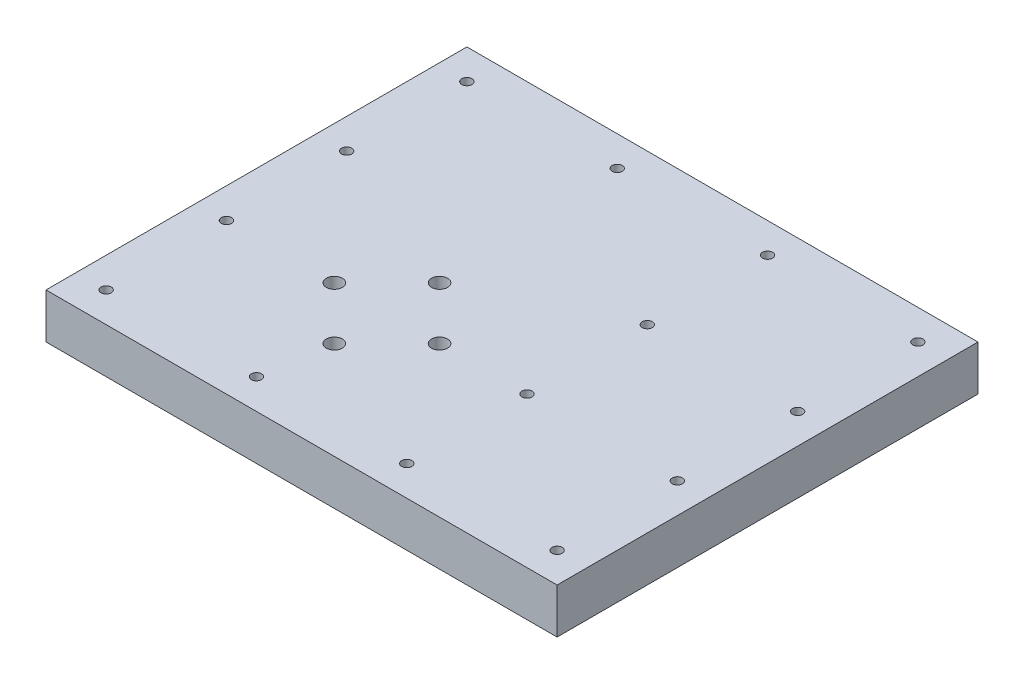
ISO-10303-21;
HEADER;
FILE_DESCRIPTION(('STEP AP214'),'2;1');
FILE_NAME('part.step','',(''),(''),'','','');
FILE_SCHEMA(('AUTOMOTIVE_DESIGN { 1 0 10303 214 1 1 1 1 }'));
ENDSEC;
DATA;
#1=APPLICATION_CONTEXT('core data for automotive mechanical design processes');
#2=APPLICATION_PROTOCOL_DEFINITION('international standard','automotive_design',2000,#1);
#3=PRODUCT_CONTEXT('',#1,'mechanical');
#4=PRODUCT('Part','Part','',(#3));
#5=PRODUCT_RELATED_PRODUCT_CATEGORY('part','',(#4));
#6=PRODUCT_DEFINITION_FORMATION('','',#4);
#7=PRODUCT_DEFINITION_CONTEXT('part definition',#1,'design');
#8=PRODUCT_DEFINITION('design','',#6,#7);
#9=PRODUCT_DEFINITION_SHAPE('','',#8);
#10=(LENGTH_UNIT() NAMED_UNIT(*) SI_UNIT(.MILLI.,.METRE.));
#11=(NAMED_UNIT(*) PLANE_ANGLE_UNIT() SI_UNIT($,.RADIAN.));
#12=(NAMED_UNIT(*) SI_UNIT($,.STERADIAN.) SOLID_ANGLE_UNIT());
#13=UNCERTAINTY_MEASURE_WITH_UNIT(LENGTH_MEASURE(1.E-05),#10,'distance_accuracy_value','');
#14=(GEOMETRIC_REPRESENTATION_CONTEXT(3) GLOBAL_UNCERTAINTY_ASSIGNED_CONTEXT((#13)) GLOBAL_UNIT_ASSIGNED_CONTEXT((#10,
#11,#12)) REPRESENTATION_CONTEXT('',''));
#15=CARTESIAN_POINT('',(0.,0.,0.));
#16=DIRECTION('',(0.,0.,1.));
#17=DIRECTION('',(1.,0.,0.));
#18=AXIS2_PLACEMENT_3D('',#15,#16,#17);
#19=CARTESIAN_POINT('',(0.,0.,0.));
#20=DIRECTION('',(0.,1.,0.));
#21=DIRECTION('',(0.,0.,1.));
#22=AXIS2_PLACEMENT_3D('',#19,#20,#21);
#23=PLANE('',#22);
#24=CARTESIAN_POINT('',(95.2500000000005,0.,-25.4));
#25=DIRECTION('',(0.,-1.,0.));
#26=DIRECTION('',(0.,0.,-1.));
#27=AXIS2_PLACEMENT_3D('',#24,#25,#26);
#28=CIRCLE('',#27,3.96874999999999);
#29=CARTESIAN_POINT('',(95.2500000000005,0.,-29.36875));
#30=VERTEX_POINT('',#29);
#31=EDGE_CURVE('E289',#30,#30,#28,.T.);
#32=ORIENTED_EDGE('',*,*,#31,.F.);
#33=EDGE_LOOP('',(#32));
#34=FACE_BOUND('',#33,.T.);
#35=CARTESIAN_POINT('',(31.7500000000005,0.,-25.4));
#36=DIRECTION('',(0.,-1.,0.));
#37=DIRECTION('',(0.,0.,-1.));
#38=AXIS2_PLACEMENT_3D('',#35,#36,#37);
#39=CIRCLE('',#38,3.96874999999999);
#40=CARTESIAN_POINT('',(31.7500000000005,0.,-29.36875));
#41=VERTEX_POINT('',#40);
#42=EDGE_CURVE('E277',#41,#41,#39,.T.);
#43=ORIENTED_EDGE('',*,*,#42,.F.);
#44=EDGE_LOOP('',(#43));
#45=FACE_BOUND('',#44,.T.);
#46=CARTESIAN_POINT('',(31.75,0.,-76.2));
#47=DIRECTION('',(0.,-1.,0.));
#48=DIRECTION('',(0.,0.,-1.));
#49=AXIS2_PLACEMENT_3D('',#46,#47,#48);
#50=CIRCLE('',#49,3.96874999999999);
#51=CARTESIAN_POINT('',(31.75,0.,-80.16875));
#52=VERTEX_POINT('',#51);
#53=EDGE_CURVE('E265',#52,#52,#50,.T.);
#54=ORIENTED_EDGE('',*,*,#53,.F.);
#55=EDGE_LOOP('',(#54));
#56=FACE_BOUND('',#55,.T.);
#57=CARTESIAN_POINT('',(-31.75,0.,-76.2));
#58=DIRECTION('',(0.,-1.,0.));
#59=DIRECTION('',(0.,0.,-1.));
#60=AXIS2_PLACEMENT_3D('',#57,#58,#59);
#61=CIRCLE('',#60,3.96875);
#62=CARTESIAN_POINT('',(-31.75,0.,-80.16875));
#63=VERTEX_POINT('',#62);
#64=EDGE_CURVE('E253',#63,#63,#61,.T.);
#65=ORIENTED_EDGE('',*,*,#64,.F.);
#66=EDGE_LOOP('',(#65));
#67=FACE_BOUND('',#66,.T.);
#68=CARTESIAN_POINT('',(-95.25,0.,-76.2));
#69=DIRECTION('',(0.,-1.,0.));
#70=DIRECTION('',(0.,0.,-1.));
#71=AXIS2_PLACEMENT_3D('',#68,#69,#70);
#72=CIRCLE('',#71,3.96874999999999);
#73=CARTESIAN_POINT('',(-95.25,0.,-80.16875));
#74=VERTEX_POINT('',#73);
#75=EDGE_CURVE('E241',#74,#74,#72,.T.);
#76=ORIENTED_EDGE('',*,*,#75,.F.);
#77=EDGE_LOOP('',(#76));
#78=FACE_BOUND('',#77,.T.);
#79=CARTESIAN_POINT('',(-95.2499999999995,0.,-25.4));
#80=DIRECTION('',(0.,-1.,0.));
#81=DIRECTION('',(0.,0.,-1.));
#82=AXIS2_PLACEMENT_3D('',#79,#80,#81);
#83=CIRCLE('',#82,3.96874999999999);
#84=CARTESIAN_POINT('',(-95.2499999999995,0.,-29.36875));
#85=VERTEX_POINT('',#84);
#86=EDGE_CURVE('E229',#85,#85,#83,.T.);
#87=ORIENTED_EDGE('',*,*,#86,.F.);
#88=EDGE_LOOP('',(#87));
#89=FACE_BOUND('',#88,.T.);
#90=CARTESIAN_POINT('',(-95.2499999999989,0.,25.4));
#91=DIRECTION('',(0.,-1.,0.));
#92=DIRECTION('',(0.,0.,-1.));
#93=AXIS2_PLACEMENT_3D('',#90,#91,#92);
#94=CIRCLE('',#93,3.96874999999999);
#95=CARTESIAN_POINT('',(-95.2499999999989,0.,21.43125));
#96=VERTEX_POINT('',#95);
#97=EDGE_CURVE('E217',#96,#96,#94,.T.);
#98=ORIENTED_EDGE('',*,*,#97,.F.);
#99=EDGE_LOOP('',(#98));
#100=FACE_BOUND('',#99,.T.);
#101=CARTESIAN_POINT('',(31.750000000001,0.,25.4));
#102=DIRECTION('',(0.,-1.,0.));
#103=DIRECTION('',(0.,0.,-1.));
#104=AXIS2_PLACEMENT_3D('',#101,#102,#103);
#105=CIRCLE('',#104,3.96874999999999);
#106=CARTESIAN_POINT('',(31.750000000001,0.,21.43125));
#107=VERTEX_POINT('',#106);
#108=EDGE_CURVE('E205',#107,#107,#105,.T.);
#109=ORIENTED_EDGE('',*,*,#108,.F.);
#110=EDGE_LOOP('',(#109));
#111=FACE_BOUND('',#110,.T.);
#112=CARTESIAN_POINT('',(95.250000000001,0.,25.4));
#113=DIRECTION('',(0.,-1.,0.));
#114=DIRECTION('',(0.,0.,-1.));
#115=AXIS2_PLACEMENT_3D('',#112,#113,#114);
#116=CIRCLE('',#115,3.96874999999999);
#117=CARTESIAN_POINT('',(95.250000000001,0.,21.43125));
#118=VERTEX_POINT('',#117);
#119=EDGE_CURVE('E193',#118,#118,#116,.T.);
#120=ORIENTED_EDGE('',*,*,#119,.F.);
#121=EDGE_LOOP('',(#120));
#122=FACE_BOUND('',#121,.T.);
#123=CARTESIAN_POINT('',(95.2500000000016,0.,76.2));
#124=DIRECTION('',(0.,-1.,0.));
#125=DIRECTION('',(0.,0.,-1.));
#126=AXIS2_PLACEMENT_3D('',#123,#124,#125);
#127=CIRCLE('',#126,3.96874999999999);
#128=CARTESIAN_POINT('',(95.2500000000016,0.,72.23125));
#129=VERTEX_POINT('',#128);
#130=EDGE_CURVE('E181',#129,#129,#127,.T.);
#131=ORIENTED_EDGE('',*,*,#130,.F.);
#132=EDGE_LOOP('',(#131));
#133=FACE_BOUND('',#132,.T.);
#134=CARTESIAN_POINT('',(31.7500000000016,0.,76.2));
#135=DIRECTION('',(0.,-1.,0.));
#136=DIRECTION('',(0.,0.,-1.));
#137=AXIS2_PLACEMENT_3D('',#134,#135,#136);
#138=CIRCLE('',#137,3.96874999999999);
#139=CARTESIAN_POINT('',(31.7500000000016,0.,72.23125));
#140=VERTEX_POINT('',#139);
#141=EDGE_CURVE('E169',#140,#140,#138,.T.);
#142=ORIENTED_EDGE('',*,*,#141,.F.);
#143=EDGE_LOOP('',(#142));
#144=FACE_BOUND('',#143,.T.);
#145=CARTESIAN_POINT('',(-31.7499999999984,0.,76.2));
#146=DIRECTION('',(0.,-1.,0.));
#147=DIRECTION('',(0.,0.,-1.));
#148=AXIS2_PLACEMENT_3D('',#145,#146,#147);
#149=CIRCLE('',#148,3.96875);
#150=CARTESIAN_POINT('',(-31.7499999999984,0.,72.23125));
#151=VERTEX_POINT('',#150);
#152=EDGE_CURVE('E157',#151,#151,#149,.T.);
#153=ORIENTED_EDGE('',*,*,#152,.F.);
#154=EDGE_LOOP('',(#153));
#155=FACE_BOUND('',#154,.T.);
#156=CARTESIAN_POINT('',(-95.2499999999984,0.,76.2));
#157=DIRECTION('',(0.,-1.,0.));
#158=DIRECTION('',(0.,0.,-1.));
#159=AXIS2_PLACEMENT_3D('',#156,#157,#158);
#160=CIRCLE('',#159,3.96874999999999);
#161=CARTESIAN_POINT('',(-95.2499999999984,0.,72.23125));
#162=VERTEX_POINT('',#161);
#163=EDGE_CURVE('E145',#162,#162,#160,.T.);
#164=ORIENTED_EDGE('',*,*,#163,.F.);
#165=EDGE_LOOP('',(#164));
#166=FACE_BOUND('',#165,.T.);
#167=CARTESIAN_POINT('',(-27.432,0.,3.17499999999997));
#168=DIRECTION('',(0.,1.,0.));
#169=DIRECTION('',(0.,0.,1.));
#170=AXIS2_PLACEMENT_3D('',#167,#168,#169);
#171=CIRCLE('',#170,3.3782);
#172=CARTESIAN_POINT('',(-27.432,0.,6.55319999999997));
#173=VERTEX_POINT('',#172);
#174=EDGE_CURVE('E124',#173,#173,#171,.T.);
#175=ORIENTED_EDGE('',*,*,#174,.T.);
#176=EDGE_LOOP('',(#175));
#177=FACE_BOUND('',#176,.T.);
#178=CARTESIAN_POINT('',(-49.657,0.,25.4));
#179=DIRECTION('',(0.,1.,0.));
#180=DIRECTION('',(0.,0.,1.));
#181=AXIS2_PLACEMENT_3D('',#178,#179,#180);
#182=CIRCLE('',#181,3.3782);
#183=CARTESIAN_POINT('',(-49.657,0.,28.7782));
#184=VERTEX_POINT('',#183);
#185=EDGE_CURVE('E132',#184,#184,#182,.T.);
#186=ORIENTED_EDGE('',*,*,#185,.T.);
#187=EDGE_LOOP('',(#186));
#188=FACE_BOUND('',#187,.T.);
#189=CARTESIAN_POINT('',(-27.432,0.,47.625));
#190=DIRECTION('',(0.,1.,0.));
#191=DIRECTION('',(0.,0.,1.));
#192=AXIS2_PLACEMENT_3D('',#189,#190,#191);
#193=CIRCLE('',#192,3.3782);
#194=CARTESIAN_POINT('',(-27.432,0.,51.0032));
#195=VERTEX_POINT('',#194);
#196=EDGE_CURVE('E128',#195,#195,#193,.T.);
#197=ORIENTED_EDGE('',*,*,#196,.T.);
#198=EDGE_LOOP('',(#197));
#199=FACE_BOUND('',#198,.T.);
#200=CARTESIAN_POINT('',(-5.20700000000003,0.,25.4));
#201=DIRECTION('',(0.,1.,0.));
#202=DIRECTION('',(0.,0.,1.));
#203=AXIS2_PLACEMENT_3D('',#200,#201,#202);
#204=CIRCLE('',#203,3.3782);
#205=CARTESIAN_POINT('',(-5.20700000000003,0.,28.7782));
#206=VERTEX_POINT('',#205);
#207=EDGE_CURVE('E125',#206,#206,#204,.T.);
#208=ORIENTED_EDGE('',*,*,#207,.T.);
#209=EDGE_LOOP('',(#208));
#210=FACE_BOUND('',#209,.T.);
#211=DIRECTION('',(0.,0.,-1.));
#212=VECTOR('',#211,1.);
#213=CARTESIAN_POINT('',(107.95,0.,-88.9));
#214=LINE('',#213,#212);
#215=CARTESIAN_POINT('',(107.95,0.,88.9));
#216=VERTEX_POINT('',#215);
#217=CARTESIAN_POINT('',(107.95,0.,-88.9));
#218=VERTEX_POINT('',#217);
#219=EDGE_CURVE('E99',#216,#218,#214,.T.);
#220=ORIENTED_EDGE('',*,*,#219,.F.);
#221=DIRECTION('',(1.,0.,0.));
#222=VECTOR('',#221,1.);
#223=CARTESIAN_POINT('',(-107.95,0.,88.9));
#224=LINE('',#223,#222);
#225=CARTESIAN_POINT('',(-107.95,0.,88.9));
#226=VERTEX_POINT('',#225);
#227=EDGE_CURVE('E74',#226,#216,#224,.T.);
#228=ORIENTED_EDGE('',*,*,#227,.F.);
#229=DIRECTION('',(0.,0.,1.));
#230=VECTOR('',#229,1.);
#231=CARTESIAN_POINT('',(-107.95,0.,-88.9));
#232=LINE('',#231,#230);
#233=CARTESIAN_POINT('',(-107.95,0.,-88.9));
#234=VERTEX_POINT('',#233);
#235=EDGE_CURVE('E68',#234,#226,#232,.T.);
#236=ORIENTED_EDGE('',*,*,#235,.F.);
#237=DIRECTION('',(-1.,0.,0.));
#238=VECTOR('',#237,1.);
#239=CARTESIAN_POINT('',(-107.95,0.,-88.9));
#240=LINE('',#239,#238);
#241=EDGE_CURVE('E91',#218,#234,#240,.T.);
#242=ORIENTED_EDGE('',*,*,#241,.F.);
#243=EDGE_LOOP('',(#220,#228,#236,#242));
#244=FACE_BOUND('',#243,.T.);
#245=CARTESIAN_POINT('',(95.25,0.,-76.2));
#246=DIRECTION('',(0.,-1.,0.));
#247=DIRECTION('',(0.,0.,-1.));
#248=AXIS2_PLACEMENT_3D('',#245,#246,#247);
#249=CIRCLE('',#248,3.96874999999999);
#250=CARTESIAN_POINT('',(95.25,0.,-80.16875));
#251=VERTEX_POINT('',#250);
#252=EDGE_CURVE('E301',#251,#251,#249,.T.);
#253=ORIENTED_EDGE('',*,*,#252,.F.);
#254=EDGE_LOOP('',(#253));
#255=FACE_BOUND('',#254,.T.);
#256=ADVANCED_FACE('F34',(#34,#45,#56,#67,#78,#89,#100,#111,#122,#133,#144,#155,#166,#177,#188,
#199,#210,#244,#255),#23,.F.);
#257=CARTESIAN_POINT('',(0.,19.05,0.));
#258=DIRECTION('',(0.,1.,0.));
#259=DIRECTION('',(0.,0.,1.));
#260=AXIS2_PLACEMENT_3D('',#257,#258,#259);
#261=PLANE('',#260);
#262=CARTESIAN_POINT('',(95.25,19.05,-76.2));
#263=DIRECTION('',(0.,-1.,0.));
#264=DIRECTION('',(0.,0.,-1.));
#265=AXIS2_PLACEMENT_3D('',#262,#263,#264);
#266=CIRCLE('',#265,2.15264999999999);
#267=CARTESIAN_POINT('',(95.25,19.05,-78.35265));
#268=VERTEX_POINT('',#267);
#269=EDGE_CURVE('E292',#268,#268,#266,.T.);
#270=ORIENTED_EDGE('',*,*,#269,.T.);
#271=EDGE_LOOP('',(#270));
#272=FACE_BOUND('',#271,.T.);
#273=CARTESIAN_POINT('',(95.2500000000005,19.05,-25.4));
#274=DIRECTION('',(0.,-1.,0.));
#275=DIRECTION('',(0.,0.,-1.));
#276=AXIS2_PLACEMENT_3D('',#273,#274,#275);
#277=CIRCLE('',#276,2.15264999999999);
#278=CARTESIAN_POINT('',(95.2500000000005,19.05,-27.55265));
#279=VERTEX_POINT('',#278);
#280=EDGE_CURVE('E280',#279,#279,#277,.T.);
#281=ORIENTED_EDGE('',*,*,#280,.T.);
#282=EDGE_LOOP('',(#281));
#283=FACE_BOUND('',#282,.T.);
#284=CARTESIAN_POINT('',(31.7500000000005,19.05,-25.4));
#285=DIRECTION('',(0.,-1.,0.));
#286=DIRECTION('',(0.,0.,-1.));
#287=AXIS2_PLACEMENT_3D('',#284,#285,#286);
#288=CIRCLE('',#287,2.15264999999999);
#289=CARTESIAN_POINT('',(31.7500000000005,19.05,-27.55265));
#290=VERTEX_POINT('',#289);
#291=EDGE_CURVE('E268',#290,#290,#288,.T.);
#292=ORIENTED_EDGE('',*,*,#291,.T.);
#293=EDGE_LOOP('',(#292));
#294=FACE_BOUND('',#293,.T.);
#295=CARTESIAN_POINT('',(31.75,19.05,-76.2));
#296=DIRECTION('',(0.,-1.,0.));
#297=DIRECTION('',(0.,0.,-1.));
#298=AXIS2_PLACEMENT_3D('',#295,#296,#297);
#299=CIRCLE('',#298,2.15264999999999);
#300=CARTESIAN_POINT('',(31.75,19.05,-78.35265));
#301=VERTEX_POINT('',#300);
#302=EDGE_CURVE('E256',#301,#301,#299,.T.);
#303=ORIENTED_EDGE('',*,*,#302,.T.);
#304=EDGE_LOOP('',(#303));
#305=FACE_BOUND('',#304,.T.);
#306=DIRECTION('',(0.,0.,-1.));
#307=VECTOR('',#306,1.);
#308=CARTESIAN_POINT('',(107.95,19.05,-88.9));
#309=LINE('',#308,#307);
#310=CARTESIAN_POINT('',(107.95,19.05,88.9));
#311=VERTEX_POINT('',#310);
#312=CARTESIAN_POINT('',(107.95,19.05,-88.9));
#313=VERTEX_POINT('',#312);
#314=EDGE_CURVE('E87',#311,#313,#309,.T.);
#315=ORIENTED_EDGE('',*,*,#314,.T.);
#316=DIRECTION('',(-1.,0.,0.));
#317=VECTOR('',#316,1.);
#318=CARTESIAN_POINT('',(-107.95,19.05,-88.9));
#319=LINE('',#318,#317);
#320=CARTESIAN_POINT('',(-107.95,19.05,-88.9));
#321=VERTEX_POINT('',#320);
#322=EDGE_CURVE('E81',#313,#321,#319,.T.);
#323=ORIENTED_EDGE('',*,*,#322,.T.);
#324=DIRECTION('',(0.,0.,1.));
#325=VECTOR('',#324,1.);
#326=CARTESIAN_POINT('',(-107.95,19.05,-88.9));
#327=LINE('',#326,#325);
#328=CARTESIAN_POINT('',(-107.95,19.05,88.9));
#329=VERTEX_POINT('',#328);
#330=EDGE_CURVE('E85',#321,#329,#327,.T.);
#331=ORIENTED_EDGE('',*,*,#330,.T.);
#332=DIRECTION('',(1.,0.,0.));
#333=VECTOR('',#332,1.);
#334=CARTESIAN_POINT('',(-107.95,19.05,88.9));
#335=LINE('',#334,#333);
#336=EDGE_CURVE('E51',#329,#311,#335,.T.);
#337=ORIENTED_EDGE('',*,*,#336,.T.);
#338=EDGE_LOOP('',(#315,#323,#331,#337));
#339=FACE_BOUND('',#338,.T.);
#340=CARTESIAN_POINT('',(-5.20700000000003,19.05,25.4));
#341=DIRECTION('',(0.,1.,0.));
#342=DIRECTION('',(0.,0.,1.));
#343=AXIS2_PLACEMENT_3D('',#340,#341,#342);
#344=CIRCLE('',#343,3.3782);
#345=CARTESIAN_POINT('',(-5.20700000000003,19.05,28.7782));
#346=VERTEX_POINT('',#345);
#347=EDGE_CURVE('E121',#346,#346,#344,.T.);
#348=ORIENTED_EDGE('',*,*,#347,.F.);
#349=EDGE_LOOP('',(#348));
#350=FACE_BOUND('',#349,.T.);
#351=CARTESIAN_POINT('',(-27.432,19.05,47.625));
#352=DIRECTION('',(0.,1.,0.));
#353=DIRECTION('',(0.,0.,1.));
#354=AXIS2_PLACEMENT_3D('',#351,#352,#353);
#355=CIRCLE('',#354,3.3782);
#356=CARTESIAN_POINT('',(-27.432,19.05,51.0032));
#357=VERTEX_POINT('',#356);
#358=EDGE_CURVE('E118',#357,#357,#355,.T.);
#359=ORIENTED_EDGE('',*,*,#358,.F.);
#360=EDGE_LOOP('',(#359));
#361=FACE_BOUND('',#360,.T.);
#362=CARTESIAN_POINT('',(-49.657,19.05,25.4));
#363=DIRECTION('',(0.,1.,0.));
#364=DIRECTION('',(0.,0.,1.));
#365=AXIS2_PLACEMENT_3D('',#362,#363,#364);
#366=CIRCLE('',#365,3.3782);
#367=CARTESIAN_POINT('',(-49.657,19.05,28.7782));
#368=VERTEX_POINT('',#367);
#369=EDGE_CURVE('E115',#368,#368,#366,.T.);
#370=ORIENTED_EDGE('',*,*,#369,.F.);
#371=EDGE_LOOP('',(#370));
#372=FACE_BOUND('',#371,.T.);
#373=CARTESIAN_POINT('',(-27.432,19.05,3.17499999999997));
#374=DIRECTION('',(0.,1.,0.));
#375=DIRECTION('',(0.,0.,1.));
#376=AXIS2_PLACEMENT_3D('',#373,#374,#375);
#377=CIRCLE('',#376,3.3782);
#378=CARTESIAN_POINT('',(-27.432,19.05,6.55319999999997));
#379=VERTEX_POINT('',#378);
#380=EDGE_CURVE('E102',#379,#379,#377,.T.);
#381=ORIENTED_EDGE('',*,*,#380,.F.);
#382=EDGE_LOOP('',(#381));
#383=FACE_BOUND('',#382,.T.);
#384=CARTESIAN_POINT('',(-95.2499999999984,19.05,76.2));
#385=DIRECTION('',(0.,-1.,0.));
#386=DIRECTION('',(0.,0.,-1.));
#387=AXIS2_PLACEMENT_3D('',#384,#385,#386);
#388=CIRCLE('',#387,2.15264999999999);
#389=CARTESIAN_POINT('',(-95.2499999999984,19.05,74.04735));
#390=VERTEX_POINT('',#389);
#391=EDGE_CURVE('E129',#390,#390,#388,.T.);
#392=ORIENTED_EDGE('',*,*,#391,.T.);
#393=EDGE_LOOP('',(#392));
#394=FACE_BOUND('',#393,.T.);
#395=CARTESIAN_POINT('',(-31.7499999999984,19.05,76.2));
#396=DIRECTION('',(0.,-1.,0.));
#397=DIRECTION('',(0.,0.,-1.));
#398=AXIS2_PLACEMENT_3D('',#395,#396,#397);
#399=CIRCLE('',#398,2.15265);
#400=CARTESIAN_POINT('',(-31.7499999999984,19.05,74.04735));
#401=VERTEX_POINT('',#400);
#402=EDGE_CURVE('E148',#401,#401,#399,.T.);
#403=ORIENTED_EDGE('',*,*,#402,.T.);
#404=EDGE_LOOP('',(#403));
#405=FACE_BOUND('',#404,.T.);
#406=CARTESIAN_POINT('',(31.7500000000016,19.05,76.2));
#407=DIRECTION('',(0.,-1.,0.));
#408=DIRECTION('',(0.,0.,-1.));
#409=AXIS2_PLACEMENT_3D('',#406,#407,#408);
#410=CIRCLE('',#409,2.15264999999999);
#411=CARTESIAN_POINT('',(31.7500000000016,19.05,74.04735));
#412=VERTEX_POINT('',#411);
#413=EDGE_CURVE('E160',#412,#412,#410,.T.);
#414=ORIENTED_EDGE('',*,*,#413,.T.);
#415=EDGE_LOOP('',(#414));
#416=FACE_BOUND('',#415,.T.);
#417=CARTESIAN_POINT('',(95.2500000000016,19.05,76.2));
#418=DIRECTION('',(0.,-1.,0.));
#419=DIRECTION('',(0.,0.,-1.));
#420=AXIS2_PLACEMENT_3D('',#417,#418,#419);
#421=CIRCLE('',#420,2.15264999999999);
#422=CARTESIAN_POINT('',(95.2500000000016,19.05,74.04735));
#423=VERTEX_POINT('',#422);
#424=EDGE_CURVE('E172',#423,#423,#421,.T.);
#425=ORIENTED_EDGE('',*,*,#424,.T.);
#426=EDGE_LOOP('',(#425));
#427=FACE_BOUND('',#426,.T.);
#428=CARTESIAN_POINT('',(95.250000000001,19.05,25.4));
#429=DIRECTION('',(0.,-1.,0.));
#430=DIRECTION('',(0.,0.,-1.));
#431=AXIS2_PLACEMENT_3D('',#428,#429,#430);
#432=CIRCLE('',#431,2.15264999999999);
#433=CARTESIAN_POINT('',(95.250000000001,19.05,23.24735));
#434=VERTEX_POINT('',#433);
#435=EDGE_CURVE('E184',#434,#434,#432,.T.);
#436=ORIENTED_EDGE('',*,*,#435,.T.);
#437=EDGE_LOOP('',(#436));
#438=FACE_BOUND('',#437,.T.);
#439=CARTESIAN_POINT('',(31.750000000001,19.05,25.4));
#440=DIRECTION('',(0.,-1.,0.));
#441=DIRECTION('',(0.,0.,-1.));
#442=AXIS2_PLACEMENT_3D('',#439,#440,#441);
#443=CIRCLE('',#442,2.15264999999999);
#444=CARTESIAN_POINT('',(31.750000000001,19.05,23.24735));
#445=VERTEX_POINT('',#444);
#446=EDGE_CURVE('E196',#445,#445,#443,.T.);
#447=ORIENTED_EDGE('',*,*,#446,.T.);
#448=EDGE_LOOP('',(#447));
#449=FACE_BOUND('',#448,.T.);
#450=CARTESIAN_POINT('',(-95.2499999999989,19.05,25.4));
#451=DIRECTION('',(0.,-1.,0.));
#452=DIRECTION('',(0.,0.,-1.));
#453=AXIS2_PLACEMENT_3D('',#450,#451,#452);
#454=CIRCLE('',#453,2.15264999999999);
#455=CARTESIAN_POINT('',(-95.2499999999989,19.05,23.24735));
#456=VERTEX_POINT('',#455);
#457=EDGE_CURVE('E208',#456,#456,#454,.T.);
#458=ORIENTED_EDGE('',*,*,#457,.T.);
#459=EDGE_LOOP('',(#458));
#460=FACE_BOUND('',#459,.T.);
#461=CARTESIAN_POINT('',(-95.2499999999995,19.05,-25.4));
#462=DIRECTION('',(0.,-1.,0.));
#463=DIRECTION('',(0.,0.,-1.));
#464=AXIS2_PLACEMENT_3D('',#461,#462,#463);
#465=CIRCLE('',#464,2.15264999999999);
#466=CARTESIAN_POINT('',(-95.2499999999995,19.05,-27.55265));
#467=VERTEX_POINT('',#466);
#468=EDGE_CURVE('E220',#467,#467,#465,.T.);
#469=ORIENTED_EDGE('',*,*,#468,.T.);
#470=EDGE_LOOP('',(#469));
#471=FACE_BOUND('',#470,.T.);
#472=CARTESIAN_POINT('',(-95.25,19.05,-76.2));
#473=DIRECTION('',(0.,-1.,0.));
#474=DIRECTION('',(0.,0.,-1.));
#475=AXIS2_PLACEMENT_3D('',#472,#473,#474);
#476=CIRCLE('',#475,2.15264999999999);
#477=CARTESIAN_POINT('',(-95.25,19.05,-78.35265));
#478=VERTEX_POINT('',#477);
#479=EDGE_CURVE('E232',#478,#478,#476,.T.);
#480=ORIENTED_EDGE('',*,*,#479,.T.);
#481=EDGE_LOOP('',(#480));
#482=FACE_BOUND('',#481,.T.);
#483=CARTESIAN_POINT('',(-31.75,19.05,-76.2));
#484=DIRECTION('',(0.,-1.,0.));
#485=DIRECTION('',(0.,0.,-1.));
#486=AXIS2_PLACEMENT_3D('',#483,#484,#485);
#487=CIRCLE('',#486,2.15265);
#488=CARTESIAN_POINT('',(-31.75,19.05,-78.35265));
#489=VERTEX_POINT('',#488);
#490=EDGE_CURVE('E244',#489,#489,#487,.T.);
#491=ORIENTED_EDGE('',*,*,#490,.T.);
#492=EDGE_LOOP('',(#491));
#493=FACE_BOUND('',#492,.T.);
#494=ADVANCED_FACE('F82',(#272,#283,#294,#305,#339,#350,#361,#372,#383,#394,#405,#416,#427,#438,
#449,#460,#471,#482,#493),#261,.T.);
#495=CARTESIAN_POINT('',(107.95,19.05,-88.9));
#496=DIRECTION('',(-1.,0.,0.));
#497=DIRECTION('',(0.,0.,1.));
#498=AXIS2_PLACEMENT_3D('',#495,#496,#497);
#499=PLANE('',#498);
#500=ORIENTED_EDGE('',*,*,#219,.T.);
#501=DIRECTION('',(0.,-1.,0.));
#502=VECTOR('',#501,1.);
#503=CARTESIAN_POINT('',(107.95,19.05,-88.9));
#504=LINE('',#503,#502);
#505=EDGE_CURVE('E11',#313,#218,#504,.T.);
#506=ORIENTED_EDGE('',*,*,#505,.F.);
#507=ORIENTED_EDGE('',*,*,#314,.F.);
#508=DIRECTION('',(0.,-1.,0.));
#509=VECTOR('',#508,1.);
#510=CARTESIAN_POINT('',(107.95,19.05,88.9));
#511=LINE('',#510,#509);
#512=EDGE_CURVE('E95',#311,#216,#511,.T.);
#513=ORIENTED_EDGE('',*,*,#512,.T.);
#514=EDGE_LOOP('',(#500,#506,#507,#513));
#515=FACE_BOUND('',#514,.T.);
#516=ADVANCED_FACE('F36',(#515),#499,.F.);
#517=CARTESIAN_POINT('',(-107.95,19.05,-88.9));
#518=DIRECTION('',(0.,0.,1.));
#519=DIRECTION('',(1.,0.,0.));
#520=AXIS2_PLACEMENT_3D('',#517,#518,#519);
#521=PLANE('',#520);
#522=ORIENTED_EDGE('',*,*,#241,.T.);
#523=DIRECTION('',(0.,-1.,0.));
#524=VECTOR('',#523,1.);
#525=CARTESIAN_POINT('',(-107.95,19.05,-88.9));
#526=LINE('',#525,#524);
#527=EDGE_CURVE('E43',#321,#234,#526,.T.);
#528=ORIENTED_EDGE('',*,*,#527,.F.);
#529=ORIENTED_EDGE('',*,*,#322,.F.);
#530=ORIENTED_EDGE('',*,*,#505,.T.);
#531=EDGE_LOOP('',(#522,#528,#529,#530));
#532=FACE_BOUND('',#531,.T.);
#533=ADVANCED_FACE('F90',(#532),#521,.F.);
#534=CARTESIAN_POINT('',(-107.95,19.05,-88.9));
#535=DIRECTION('',(1.,0.,0.));
#536=DIRECTION('',(0.,0.,-1.));
#537=AXIS2_PLACEMENT_3D('',#534,#535,#536);
#538=PLANE('',#537);
#539=ORIENTED_EDGE('',*,*,#235,.T.);
#540=DIRECTION('',(0.,-1.,0.));
#541=VECTOR('',#540,1.);
#542=CARTESIAN_POINT('',(-107.95,19.05,88.9));
#543=LINE('',#542,#541);
#544=EDGE_CURVE('E92',#329,#226,#543,.T.);
#545=ORIENTED_EDGE('',*,*,#544,.F.);
#546=ORIENTED_EDGE('',*,*,#330,.F.);
#547=ORIENTED_EDGE('',*,*,#527,.T.);
#548=EDGE_LOOP('',(#539,#545,#546,#547));
#549=FACE_BOUND('',#548,.T.);
#550=ADVANCED_FACE('F93',(#549),#538,.F.);
#551=CARTESIAN_POINT('',(-107.95,19.05,88.9));
#552=DIRECTION('',(0.,0.,-1.));
#553=DIRECTION('',(-1.,0.,0.));
#554=AXIS2_PLACEMENT_3D('',#551,#552,#553);
#555=PLANE('',#554);
#556=ORIENTED_EDGE('',*,*,#227,.T.);
#557=ORIENTED_EDGE('',*,*,#512,.F.);
#558=ORIENTED_EDGE('',*,*,#336,.F.);
#559=ORIENTED_EDGE('',*,*,#544,.T.);
#560=EDGE_LOOP('',(#556,#557,#558,#559));
#561=FACE_BOUND('',#560,.T.);
#562=ADVANCED_FACE('F107',(#561),#555,.F.);
#563=CARTESIAN_POINT('',(-5.20700000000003,0.,25.4));
#564=DIRECTION('',(0.,1.,0.));
#565=DIRECTION('',(0.,0.,1.));
#566=AXIS2_PLACEMENT_3D('',#563,#564,#565);
#567=CYLINDRICAL_SURFACE('',#566,3.3782);
#568=CARTESIAN_POINT('',(-5.20700000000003,19.05,28.7782));
#569=CARTESIAN_POINT('',(-5.20700000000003,18.8515625,28.7782));
#570=CARTESIAN_POINT('',(-5.20700000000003,18.653125,28.7782));
#571=CARTESIAN_POINT('',(-5.20700000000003,18.25625,28.7782));
#572=CARTESIAN_POINT('',(-5.20700000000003,18.0578125,28.7782));
#573=CARTESIAN_POINT('',(-5.20700000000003,17.6609375,28.7782));
#574=CARTESIAN_POINT('',(-5.20700000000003,17.4625,28.7782));
#575=CARTESIAN_POINT('',(-5.20700000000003,17.065625,28.7782));
#576=CARTESIAN_POINT('',(-5.20700000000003,16.8671875,28.7782));
#577=CARTESIAN_POINT('',(-5.20700000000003,16.4703125,28.7782));
#578=CARTESIAN_POINT('',(-5.20700000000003,16.271875,28.7782));
#579=CARTESIAN_POINT('',(-5.20700000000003,15.875,28.7782));
#580=CARTESIAN_POINT('',(-5.20700000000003,15.6765625,28.7782));
#581=CARTESIAN_POINT('',(-5.20700000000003,15.2796875,28.7782));
#582=CARTESIAN_POINT('',(-5.20700000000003,15.08125,28.7782));
#583=CARTESIAN_POINT('',(-5.20700000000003,14.684375,28.7782));
#584=CARTESIAN_POINT('',(-5.20700000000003,14.4859375,28.7782));
#585=CARTESIAN_POINT('',(-5.20700000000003,14.0890625,28.7782));
#586=CARTESIAN_POINT('',(-5.20700000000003,13.890625,28.7782));
#587=CARTESIAN_POINT('',(-5.20700000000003,13.49375,28.7782));
#588=CARTESIAN_POINT('',(-5.20700000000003,13.2953125,28.7782));
#589=CARTESIAN_POINT('',(-5.20700000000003,12.8984375,28.7782));
#590=CARTESIAN_POINT('',(-5.20700000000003,12.7,28.7782));
#591=CARTESIAN_POINT('',(-5.20700000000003,12.303125,28.7782));
#592=CARTESIAN_POINT('',(-5.20700000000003,12.1046875,28.7782));
#593=CARTESIAN_POINT('',(-5.20700000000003,11.7078125,28.7782));
#594=CARTESIAN_POINT('',(-5.20700000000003,11.509375,28.7782));
#595=CARTESIAN_POINT('',(-5.20700000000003,11.1125,28.7782));
#596=CARTESIAN_POINT('',(-5.20700000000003,10.9140625,28.7782));
#597=CARTESIAN_POINT('',(-5.20700000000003,10.5171875,28.7782));
#598=CARTESIAN_POINT('',(-5.20700000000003,10.31875,28.7782));
#599=CARTESIAN_POINT('',(-5.20700000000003,9.921875,28.7782));
#600=CARTESIAN_POINT('',(-5.20700000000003,9.7234375,28.7782));
#601=CARTESIAN_POINT('',(-5.20700000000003,9.3265625,28.7782));
#602=CARTESIAN_POINT('',(-5.20700000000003,9.128125,28.7782));
#603=CARTESIAN_POINT('',(-5.20700000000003,8.73125,28.7782));
#604=CARTESIAN_POINT('',(-5.20700000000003,8.5328125,28.7782));
#605=CARTESIAN_POINT('',(-5.20700000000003,8.1359375,28.7782));
#606=CARTESIAN_POINT('',(-5.20700000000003,7.9375,28.7782));
#607=CARTESIAN_POINT('',(-5.20700000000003,7.540625,28.7782));
#608=CARTESIAN_POINT('',(-5.20700000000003,7.3421875,28.7782));
#609=CARTESIAN_POINT('',(-5.20700000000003,6.9453125,28.7782));
#610=CARTESIAN_POINT('',(-5.20700000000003,6.746875,28.7782));
#611=CARTESIAN_POINT('',(-5.20700000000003,6.35,28.7782));
#612=CARTESIAN_POINT('',(-5.20700000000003,6.1515625,28.7782));
#613=CARTESIAN_POINT('',(-5.20700000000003,5.7546875,28.7782));
#614=CARTESIAN_POINT('',(-5.20700000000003,5.55625,28.7782));
#615=CARTESIAN_POINT('',(-5.20700000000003,5.159375,28.7782));
#616=CARTESIAN_POINT('',(-5.20700000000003,4.9609375,28.7782));
#617=CARTESIAN_POINT('',(-5.20700000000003,4.5640625,28.7782));
#618=CARTESIAN_POINT('',(-5.20700000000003,4.365625,28.7782));
#619=CARTESIAN_POINT('',(-5.20700000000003,3.96875,28.7782));
#620=CARTESIAN_POINT('',(-5.20700000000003,3.7703125,28.7782));
#621=CARTESIAN_POINT('',(-5.20700000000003,3.3734375,28.7782));
#622=CARTESIAN_POINT('',(-5.20700000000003,3.175,28.7782));
#623=CARTESIAN_POINT('',(-5.20700000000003,2.778125,28.7782));
#624=CARTESIAN_POINT('',(-5.20700000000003,2.5796875,28.7782));
#625=CARTESIAN_POINT('',(-5.20700000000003,2.1828125,28.7782));
#626=CARTESIAN_POINT('',(-5.20700000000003,1.984375,28.7782));
#627=CARTESIAN_POINT('',(-5.20700000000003,1.5875,28.7782));
#628=CARTESIAN_POINT('',(-5.20700000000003,1.3890625,28.7782));
#629=CARTESIAN_POINT('',(-5.20700000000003,0.9921875,28.7782));
#630=CARTESIAN_POINT('',(-5.20700000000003,0.79375,28.7782));
#631=CARTESIAN_POINT('',(-5.20700000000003,0.396875,28.7782));
#632=CARTESIAN_POINT('',(-5.20700000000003,0.1984375,28.7782));
#633=CARTESIAN_POINT('',(-5.20700000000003,0.,28.7782));
#634=B_SPLINE_CURVE_WITH_KNOTS('',3,(#568,#569,#570,#571,#572,#573,#574,#575,#576,#577,#578,
#579,#580,#581,#582,#583,#584,#585,#586,#587,#588,#589,#590,#591,#592,#593,#594,#595,#596,#597,
#598,#599,#600,#601,#602,#603,#604,#605,#606,#607,#608,#609,#610,#611,#612,#613,#614,#615,#616,
#617,#618,#619,#620,#621,#622,#623,#624,#625,#626,#627,#628,#629,#630,#631,#632,#633),
.UNSPECIFIED.,.F.,.F.,(4,2,2,2,2,2,2,2,2,2,2,2,2,2,2,2,2,2,2,2,2,2,2,2,2,2,2,2,2,2,2,2,4),(0.,
0.5953125,1.190625,1.7859375,2.38125,2.9765625,3.571875,4.1671875,4.7625,5.3578125,5.953125,
6.5484375,7.14375,7.7390625,8.334375,8.9296875,9.525,10.1203125,10.715625,11.3109375,11.90625,
12.5015625,13.096875,13.6921875,14.2875,14.8828125,15.478125,16.0734375,16.66875,17.2640625,
17.859375,18.4546875,19.05),.UNSPECIFIED.);
#635=EDGE_CURVE('BSEAM320',#346,#206,#634,.T.);
#636=ORIENTED_EDGE('',*,*,#347,.T.);
#637=ORIENTED_EDGE('',*,*,#207,.F.);
#638=ORIENTED_EDGE('',*,*,#635,.T.);
#639=ORIENTED_EDGE('',*,*,#635,.F.);
#640=EDGE_LOOP('',(#636,#638,#637,#639));
#641=FACE_BOUND('',#640,.T.);
#642=ADVANCED_FACE('F320',(#641),#567,.F.);
#643=CARTESIAN_POINT('',(-27.432,0.,47.625));
#644=DIRECTION('',(0.,1.,0.));
#645=DIRECTION('',(0.,0.,1.));
#646=AXIS2_PLACEMENT_3D('',#643,#644,#645);
#647=CYLINDRICAL_SURFACE('',#646,3.3782);
#648=CARTESIAN_POINT('',(-27.432,19.05,51.0032));
#649=CARTESIAN_POINT('',(-27.432,18.8515625,51.0032));
#650=CARTESIAN_POINT('',(-27.432,18.653125,51.0032));
#651=CARTESIAN_POINT('',(-27.432,18.25625,51.0032));
#652=CARTESIAN_POINT('',(-27.432,18.0578125,51.0032));
#653=CARTESIAN_POINT('',(-27.432,17.6609375,51.0032));
#654=CARTESIAN_POINT('',(-27.432,17.4625,51.0032));
#655=CARTESIAN_POINT('',(-27.432,17.065625,51.0032));
#656=CARTESIAN_POINT('',(-27.432,16.8671875,51.0032));
#657=CARTESIAN_POINT('',(-27.432,16.4703125,51.0032));
#658=CARTESIAN_POINT('',(-27.432,16.271875,51.0032));
#659=CARTESIAN_POINT('',(-27.432,15.875,51.0032));
#660=CARTESIAN_POINT('',(-27.432,15.6765625,51.0032));
#661=CARTESIAN_POINT('',(-27.432,15.2796875,51.0032));
#662=CARTESIAN_POINT('',(-27.432,15.08125,51.0032));
#663=CARTESIAN_POINT('',(-27.432,14.684375,51.0032));
#664=CARTESIAN_POINT('',(-27.432,14.4859375,51.0032));
#665=CARTESIAN_POINT('',(-27.432,14.0890625,51.0032));
#666=CARTESIAN_POINT('',(-27.432,13.890625,51.0032));
#667=CARTESIAN_POINT('',(-27.432,13.49375,51.0032));
#668=CARTESIAN_POINT('',(-27.432,13.2953125,51.0032));
#669=CARTESIAN_POINT('',(-27.432,12.8984375,51.0032));
#670=CARTESIAN_POINT('',(-27.432,12.7,51.0032));
#671=CARTESIAN_POINT('',(-27.432,12.303125,51.0032));
#672=CARTESIAN_POINT('',(-27.432,12.1046875,51.0032));
#673=CARTESIAN_POINT('',(-27.432,11.7078125,51.0032));
#674=CARTESIAN_POINT('',(-27.432,11.509375,51.0032));
#675=CARTESIAN_POINT('',(-27.432,11.1125,51.0032));
#676=CARTESIAN_POINT('',(-27.432,10.9140625,51.0032));
#677=CARTESIAN_POINT('',(-27.432,10.5171875,51.0032));
#678=CARTESIAN_POINT('',(-27.432,10.31875,51.0032));
#679=CARTESIAN_POINT('',(-27.432,9.921875,51.0032));
#680=CARTESIAN_POINT('',(-27.432,9.7234375,51.0032));
#681=CARTESIAN_POINT('',(-27.432,9.3265625,51.0032));
#682=CARTESIAN_POINT('',(-27.432,9.128125,51.0032));
#683=CARTESIAN_POINT('',(-27.432,8.73125,51.0032));
#684=CARTESIAN_POINT('',(-27.432,8.5328125,51.0032));
#685=CARTESIAN_POINT('',(-27.432,8.1359375,51.0032));
#686=CARTESIAN_POINT('',(-27.432,7.9375,51.0032));
#687=CARTESIAN_POINT('',(-27.432,7.540625,51.0032));
#688=CARTESIAN_POINT('',(-27.432,7.3421875,51.0032));
#689=CARTESIAN_POINT('',(-27.432,6.9453125,51.0032));
#690=CARTESIAN_POINT('',(-27.432,6.746875,51.0032));
#691=CARTESIAN_POINT('',(-27.432,6.35,51.0032));
#692=CARTESIAN_POINT('',(-27.432,6.1515625,51.0032));
#693=CARTESIAN_POINT('',(-27.432,5.7546875,51.0032));
#694=CARTESIAN_POINT('',(-27.432,5.55625,51.0032));
#695=CARTESIAN_POINT('',(-27.432,5.159375,51.0032));
#696=CARTESIAN_POINT('',(-27.432,4.9609375,51.0032));
#697=CARTESIAN_POINT('',(-27.432,4.5640625,51.0032));
#698=CARTESIAN_POINT('',(-27.432,4.365625,51.0032));
#699=CARTESIAN_POINT('',(-27.432,3.96875,51.0032));
#700=CARTESIAN_POINT('',(-27.432,3.7703125,51.0032));
#701=CARTESIAN_POINT('',(-27.432,3.3734375,51.0032));
#702=CARTESIAN_POINT('',(-27.432,3.175,51.0032));
#703=CARTESIAN_POINT('',(-27.432,2.778125,51.0032));
#704=CARTESIAN_POINT('',(-27.432,2.5796875,51.0032));
#705=CARTESIAN_POINT('',(-27.432,2.1828125,51.0032));
#706=CARTESIAN_POINT('',(-27.432,1.984375,51.0032));
#707=CARTESIAN_POINT('',(-27.432,1.5875,51.0032));
#708=CARTESIAN_POINT('',(-27.432,1.3890625,51.0032));
#709=CARTESIAN_POINT('',(-27.432,0.9921875,51.0032));
#710=CARTESIAN_POINT('',(-27.432,0.79375,51.0032));
#711=CARTESIAN_POINT('',(-27.432,0.396875,51.0032));
#712=CARTESIAN_POINT('',(-27.432,0.1984375,51.0032));
#713=CARTESIAN_POINT('',(-27.432,0.,51.0032));
#714=B_SPLINE_CURVE_WITH_KNOTS('',3,(#648,#649,#650,#651,#652,#653,#654,#655,#656,#657,#658,
#659,#660,#661,#662,#663,#664,#665,#666,#667,#668,#669,#670,#671,#672,#673,#674,#675,#676,#677,
#678,#679,#680,#681,#682,#683,#684,#685,#686,#687,#688,#689,#690,#691,#692,#693,#694,#695,#696,
#697,#698,#699,#700,#701,#702,#703,#704,#705,#706,#707,#708,#709,#710,#711,#712,#713),
.UNSPECIFIED.,.F.,.F.,(4,2,2,2,2,2,2,2,2,2,2,2,2,2,2,2,2,2,2,2,2,2,2,2,2,2,2,2,2,2,2,2,4),(0.,
0.5953125,1.190625,1.7859375,2.38125,2.9765625,3.571875,4.1671875,4.7625,5.3578125,5.953125,
6.5484375,7.14375,7.7390625,8.334375,8.9296875,9.525,10.1203125,10.715625,11.3109375,11.90625,
12.5015625,13.096875,13.6921875,14.2875,14.8828125,15.478125,16.0734375,16.66875,17.2640625,
17.859375,18.4546875,19.05),.UNSPECIFIED.);
#715=EDGE_CURVE('BSEAM768',#357,#195,#714,.T.);
#716=ORIENTED_EDGE('',*,*,#358,.T.);
#717=ORIENTED_EDGE('',*,*,#196,.F.);
#718=ORIENTED_EDGE('',*,*,#715,.T.);
#719=ORIENTED_EDGE('',*,*,#715,.F.);
#720=EDGE_LOOP('',(#716,#718,#717,#719));
#721=FACE_BOUND('',#720,.T.);
#722=ADVANCED_FACE('F768',(#721),#647,.F.);
#723=CARTESIAN_POINT('',(-49.657,0.,25.4));
#724=DIRECTION('',(0.,1.,0.));
#725=DIRECTION('',(0.,0.,1.));
#726=AXIS2_PLACEMENT_3D('',#723,#724,#725);
#727=CYLINDRICAL_SURFACE('',#726,3.3782);
#728=CARTESIAN_POINT('',(-49.657,19.05,28.7782));
#729=CARTESIAN_POINT('',(-49.657,18.8515625,28.7782));
#730=CARTESIAN_POINT('',(-49.657,18.653125,28.7782));
#731=CARTESIAN_POINT('',(-49.657,18.25625,28.7782));
#732=CARTESIAN_POINT('',(-49.657,18.0578125,28.7782));
#733=CARTESIAN_POINT('',(-49.657,17.6609375,28.7782));
#734=CARTESIAN_POINT('',(-49.657,17.4625,28.7782));
#735=CARTESIAN_POINT('',(-49.657,17.065625,28.7782));
#736=CARTESIAN_POINT('',(-49.657,16.8671875,28.7782));
#737=CARTESIAN_POINT('',(-49.657,16.4703125,28.7782));
#738=CARTESIAN_POINT('',(-49.657,16.271875,28.7782));
#739=CARTESIAN_POINT('',(-49.657,15.875,28.7782));
#740=CARTESIAN_POINT('',(-49.657,15.6765625,28.7782));
#741=CARTESIAN_POINT('',(-49.657,15.2796875,28.7782));
#742=CARTESIAN_POINT('',(-49.657,15.08125,28.7782));
#743=CARTESIAN_POINT('',(-49.657,14.684375,28.7782));
#744=CARTESIAN_POINT('',(-49.657,14.4859375,28.7782));
#745=CARTESIAN_POINT('',(-49.657,14.0890625,28.7782));
#746=CARTESIAN_POINT('',(-49.657,13.890625,28.7782));
#747=CARTESIAN_POINT('',(-49.657,13.49375,28.7782));
#748=CARTESIAN_POINT('',(-49.657,13.2953125,28.7782));
#749=CARTESIAN_POINT('',(-49.657,12.8984375,28.7782));
#750=CARTESIAN_POINT('',(-49.657,12.7,28.7782));
#751=CARTESIAN_POINT('',(-49.657,12.303125,28.7782));
#752=CARTESIAN_POINT('',(-49.657,12.1046875,28.7782));
#753=CARTESIAN_POINT('',(-49.657,11.7078125,28.7782));
#754=CARTESIAN_POINT('',(-49.657,11.509375,28.7782));
#755=CARTESIAN_POINT('',(-49.657,11.1125,28.7782));
#756=CARTESIAN_POINT('',(-49.657,10.9140625,28.7782));
#757=CARTESIAN_POINT('',(-49.657,10.5171875,28.7782));
#758=CARTESIAN_POINT('',(-49.657,10.31875,28.7782));
#759=CARTESIAN_POINT('',(-49.657,9.921875,28.7782));
#760=CARTESIAN_POINT('',(-49.657,9.7234375,28.7782));
#761=CARTESIAN_POINT('',(-49.657,9.3265625,28.7782));
#762=CARTESIAN_POINT('',(-49.657,9.128125,28.7782));
#763=CARTESIAN_POINT('',(-49.657,8.73125,28.7782));
#764=CARTESIAN_POINT('',(-49.657,8.5328125,28.7782));
#765=CARTESIAN_POINT('',(-49.657,8.1359375,28.7782));
#766=CARTESIAN_POINT('',(-49.657,7.9375,28.7782));
#767=CARTESIAN_POINT('',(-49.657,7.540625,28.7782));
#768=CARTESIAN_POINT('',(-49.657,7.3421875,28.7782));
#769=CARTESIAN_POINT('',(-49.657,6.9453125,28.7782));
#770=CARTESIAN_POINT('',(-49.657,6.746875,28.7782));
#771=CARTESIAN_POINT('',(-49.657,6.35,28.7782));
#772=CARTESIAN_POINT('',(-49.657,6.1515625,28.7782));
#773=CARTESIAN_POINT('',(-49.657,5.7546875,28.7782));
#774=CARTESIAN_POINT('',(-49.657,5.55625,28.7782));
#775=CARTESIAN_POINT('',(-49.657,5.159375,28.7782));
#776=CARTESIAN_POINT('',(-49.657,4.9609375,28.7782));
#777=CARTESIAN_POINT('',(-49.657,4.5640625,28.7782));
#778=CARTESIAN_POINT('',(-49.657,4.365625,28.7782));
#779=CARTESIAN_POINT('',(-49.657,3.96875,28.7782));
#780=CARTESIAN_POINT('',(-49.657,3.7703125,28.7782));
#781=CARTESIAN_POINT('',(-49.657,3.3734375,28.7782));
#782=CARTESIAN_POINT('',(-49.657,3.175,28.7782));
#783=CARTESIAN_POINT('',(-49.657,2.778125,28.7782));
#784=CARTESIAN_POINT('',(-49.657,2.5796875,28.7782));
#785=CARTESIAN_POINT('',(-49.657,2.1828125,28.7782));
#786=CARTESIAN_POINT('',(-49.657,1.984375,28.7782));
#787=CARTESIAN_POINT('',(-49.657,1.5875,28.7782));
#788=CARTESIAN_POINT('',(-49.657,1.3890625,28.7782));
#789=CARTESIAN_POINT('',(-49.657,0.9921875,28.7782));
#790=CARTESIAN_POINT('',(-49.657,0.79375,28.7782));
#791=CARTESIAN_POINT('',(-49.657,0.396875,28.7782));
#792=CARTESIAN_POINT('',(-49.657,0.1984375,28.7782));
#793=CARTESIAN_POINT('',(-49.657,0.,28.7782));
#794=B_SPLINE_CURVE_WITH_KNOTS('',3,(#728,#729,#730,#731,#732,#733,#734,#735,#736,#737,#738,
#739,#740,#741,#742,#743,#744,#745,#746,#747,#748,#749,#750,#751,#752,#753,#754,#755,#756,#757,
#758,#759,#760,#761,#762,#763,#764,#765,#766,#767,#768,#769,#770,#771,#772,#773,#774,#775,#776,
#777,#778,#779,#780,#781,#782,#783,#784,#785,#786,#787,#788,#789,#790,#791,#792,#793),
.UNSPECIFIED.,.F.,.F.,(4,2,2,2,2,2,2,2,2,2,2,2,2,2,2,2,2,2,2,2,2,2,2,2,2,2,2,2,2,2,2,2,4),(0.,
0.5953125,1.190625,1.7859375,2.38125,2.9765625,3.571875,4.1671875,4.7625,5.3578125,5.953125,
6.5484375,7.14375,7.7390625,8.334375,8.9296875,9.525,10.1203125,10.715625,11.3109375,11.90625,
12.5015625,13.096875,13.6921875,14.2875,14.8828125,15.478125,16.0734375,16.66875,17.2640625,
17.859375,18.4546875,19.05),.UNSPECIFIED.);
#795=EDGE_CURVE('BSEAM764',#368,#184,#794,.T.);
#796=ORIENTED_EDGE('',*,*,#369,.T.);
#797=ORIENTED_EDGE('',*,*,#185,.F.);
#798=ORIENTED_EDGE('',*,*,#795,.T.);
#799=ORIENTED_EDGE('',*,*,#795,.F.);
#800=EDGE_LOOP('',(#796,#798,#797,#799));
#801=FACE_BOUND('',#800,.T.);
#802=ADVANCED_FACE('F764',(#801),#727,.F.);
#803=CARTESIAN_POINT('',(-27.432,0.,3.17499999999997));
#804=DIRECTION('',(0.,1.,0.));
#805=DIRECTION('',(0.,0.,1.));
#806=AXIS2_PLACEMENT_3D('',#803,#804,#805);
#807=CYLINDRICAL_SURFACE('',#806,3.3782);
#808=CARTESIAN_POINT('',(-27.432,19.05,6.55319999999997));
#809=CARTESIAN_POINT('',(-27.432,18.8515625,6.55319999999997));
#810=CARTESIAN_POINT('',(-27.432,18.653125,6.55319999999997));
#811=CARTESIAN_POINT('',(-27.432,18.25625,6.55319999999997));
#812=CARTESIAN_POINT('',(-27.432,18.0578125,6.55319999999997));
#813=CARTESIAN_POINT('',(-27.432,17.6609375,6.55319999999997));
#814=CARTESIAN_POINT('',(-27.432,17.4625,6.55319999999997));
#815=CARTESIAN_POINT('',(-27.432,17.065625,6.55319999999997));
#816=CARTESIAN_POINT('',(-27.432,16.8671875,6.55319999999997));
#817=CARTESIAN_POINT('',(-27.432,16.4703125,6.55319999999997));
#818=CARTESIAN_POINT('',(-27.432,16.271875,6.55319999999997));
#819=CARTESIAN_POINT('',(-27.432,15.875,6.55319999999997));
#820=CARTESIAN_POINT('',(-27.432,15.6765625,6.55319999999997));
#821=CARTESIAN_POINT('',(-27.432,15.2796875,6.55319999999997));
#822=CARTESIAN_POINT('',(-27.432,15.08125,6.55319999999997));
#823=CARTESIAN_POINT('',(-27.432,14.684375,6.55319999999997));
#824=CARTESIAN_POINT('',(-27.432,14.4859375,6.55319999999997));
#825=CARTESIAN_POINT('',(-27.432,14.0890625,6.55319999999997));
#826=CARTESIAN_POINT('',(-27.432,13.890625,6.55319999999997));
#827=CARTESIAN_POINT('',(-27.432,13.49375,6.55319999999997));
#828=CARTESIAN_POINT('',(-27.432,13.2953125,6.55319999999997));
#829=CARTESIAN_POINT('',(-27.432,12.8984375,6.55319999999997));
#830=CARTESIAN_POINT('',(-27.432,12.7,6.55319999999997));
#831=CARTESIAN_POINT('',(-27.432,12.303125,6.55319999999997));
#832=CARTESIAN_POINT('',(-27.432,12.1046875,6.55319999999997));
#833=CARTESIAN_POINT('',(-27.432,11.7078125,6.55319999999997));
#834=CARTESIAN_POINT('',(-27.432,11.509375,6.55319999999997));
#835=CARTESIAN_POINT('',(-27.432,11.1125,6.55319999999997));
#836=CARTESIAN_POINT('',(-27.432,10.9140625,6.55319999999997));
#837=CARTESIAN_POINT('',(-27.432,10.5171875,6.55319999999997));
#838=CARTESIAN_POINT('',(-27.432,10.31875,6.55319999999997));
#839=CARTESIAN_POINT('',(-27.432,9.921875,6.55319999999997));
#840=CARTESIAN_POINT('',(-27.432,9.7234375,6.55319999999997));
#841=CARTESIAN_POINT('',(-27.432,9.3265625,6.55319999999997));
#842=CARTESIAN_POINT('',(-27.432,9.128125,6.55319999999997));
#843=CARTESIAN_POINT('',(-27.432,8.73125,6.55319999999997));
#844=CARTESIAN_POINT('',(-27.432,8.5328125,6.55319999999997));
#845=CARTESIAN_POINT('',(-27.432,8.1359375,6.55319999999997));
#846=CARTESIAN_POINT('',(-27.432,7.9375,6.55319999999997));
#847=CARTESIAN_POINT('',(-27.432,7.540625,6.55319999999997));
#848=CARTESIAN_POINT('',(-27.432,7.3421875,6.55319999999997));
#849=CARTESIAN_POINT('',(-27.432,6.9453125,6.55319999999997));
#850=CARTESIAN_POINT('',(-27.432,6.746875,6.55319999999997));
#851=CARTESIAN_POINT('',(-27.432,6.35,6.55319999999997));
#852=CARTESIAN_POINT('',(-27.432,6.1515625,6.55319999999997));
#853=CARTESIAN_POINT('',(-27.432,5.7546875,6.55319999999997));
#854=CARTESIAN_POINT('',(-27.432,5.55625,6.55319999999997));
#855=CARTESIAN_POINT('',(-27.432,5.159375,6.55319999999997));
#856=CARTESIAN_POINT('',(-27.432,4.9609375,6.55319999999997));
#857=CARTESIAN_POINT('',(-27.432,4.5640625,6.55319999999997));
#858=CARTESIAN_POINT('',(-27.432,4.365625,6.55319999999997));
#859=CARTESIAN_POINT('',(-27.432,3.96875,6.55319999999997));
#860=CARTESIAN_POINT('',(-27.432,3.7703125,6.55319999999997));
#861=CARTESIAN_POINT('',(-27.432,3.3734375,6.55319999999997));
#862=CARTESIAN_POINT('',(-27.432,3.175,6.55319999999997));
#863=CARTESIAN_POINT('',(-27.432,2.778125,6.55319999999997));
#864=CARTESIAN_POINT('',(-27.432,2.5796875,6.55319999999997));
#865=CARTESIAN_POINT('',(-27.432,2.1828125,6.55319999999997));
#866=CARTESIAN_POINT('',(-27.432,1.984375,6.55319999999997));
#867=CARTESIAN_POINT('',(-27.432,1.5875,6.55319999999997));
#868=CARTESIAN_POINT('',(-27.432,1.3890625,6.55319999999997));
#869=CARTESIAN_POINT('',(-27.432,0.9921875,6.55319999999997));
#870=CARTESIAN_POINT('',(-27.432,0.79375,6.55319999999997));
#871=CARTESIAN_POINT('',(-27.432,0.396875,6.55319999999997));
#872=CARTESIAN_POINT('',(-27.432,0.1984375,6.55319999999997));
#873=CARTESIAN_POINT('',(-27.432,0.,6.55319999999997));
#874=B_SPLINE_CURVE_WITH_KNOTS('',3,(#808,#809,#810,#811,#812,#813,#814,#815,#816,#817,#818,
#819,#820,#821,#822,#823,#824,#825,#826,#827,#828,#829,#830,#831,#832,#833,#834,#835,#836,#837,
#838,#839,#840,#841,#842,#843,#844,#845,#846,#847,#848,#849,#850,#851,#852,#853,#854,#855,#856,
#857,#858,#859,#860,#861,#862,#863,#864,#865,#866,#867,#868,#869,#870,#871,#872,#873),
.UNSPECIFIED.,.F.,.F.,(4,2,2,2,2,2,2,2,2,2,2,2,2,2,2,2,2,2,2,2,2,2,2,2,2,2,2,2,2,2,2,2,4),(0.,
0.5953125,1.190625,1.7859375,2.38125,2.9765625,3.571875,4.1671875,4.7625,5.3578125,5.953125,
6.5484375,7.14375,7.7390625,8.334375,8.9296875,9.525,10.1203125,10.715625,11.3109375,11.90625,
12.5015625,13.096875,13.6921875,14.2875,14.8828125,15.478125,16.0734375,16.66875,17.2640625,
17.859375,18.4546875,19.05),.UNSPECIFIED.);
#875=EDGE_CURVE('BSEAM347',#379,#173,#874,.T.);
#876=ORIENTED_EDGE('',*,*,#380,.T.);
#877=ORIENTED_EDGE('',*,*,#174,.F.);
#878=ORIENTED_EDGE('',*,*,#875,.T.);
#879=ORIENTED_EDGE('',*,*,#875,.F.);
#880=EDGE_LOOP('',(#876,#878,#877,#879));
#881=FACE_BOUND('',#880,.T.);
#882=ADVANCED_FACE('F347',(#881),#807,.F.);
#883=CARTESIAN_POINT('',(-95.2499999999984,0.,76.2));
#884=DIRECTION('',(0.,-1.,0.));
#885=DIRECTION('',(0.,0.,-1.));
#886=AXIS2_PLACEMENT_3D('',#883,#884,#885);
#887=CYLINDRICAL_SURFACE('',#886,2.15265);
#888=ORIENTED_EDGE('',*,*,#391,.F.);
#889=EDGE_LOOP('',(#888));
#890=FACE_BOUND('',#889,.T.);
#891=CARTESIAN_POINT('',(-95.2499999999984,4.4196,76.2));
#892=DIRECTION('',(0.,-1.,0.));
#893=DIRECTION('',(0.,0.,-1.));
#894=AXIS2_PLACEMENT_3D('',#891,#892,#893);
#895=CIRCLE('',#894,2.15265000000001);
#896=CARTESIAN_POINT('',(-95.2499999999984,4.4196,74.04735));
#897=VERTEX_POINT('',#896);
#898=EDGE_CURVE('E139',#897,#897,#895,.T.);
#899=ORIENTED_EDGE('',*,*,#898,.T.);
#900=EDGE_LOOP('',(#899));
#901=FACE_BOUND('',#900,.T.);
#902=ADVANCED_FACE('F341',(#890,#901),#887,.F.);
#903=CARTESIAN_POINT('',(-93.0973499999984,4.4196,76.2));
#904=DIRECTION('',(0.,1.,0.));
#905=DIRECTION('',(0.,0.,1.));
#906=AXIS2_PLACEMENT_3D('',#903,#904,#905);
#907=PLANE('',#906);
#908=ORIENTED_EDGE('',*,*,#898,.F.);
#909=EDGE_LOOP('',(#908));
#910=FACE_BOUND('',#909,.T.);
#911=CARTESIAN_POINT('',(-95.2499999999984,4.4196,76.2));
#912=DIRECTION('',(0.,-1.,0.));
#913=DIRECTION('',(0.,0.,-1.));
#914=AXIS2_PLACEMENT_3D('',#911,#912,#913);
#915=CIRCLE('',#914,3.96874999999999);
#916=CARTESIAN_POINT('',(-95.2499999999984,4.4196,72.23125));
#917=VERTEX_POINT('',#916);
#918=EDGE_CURVE('E142',#917,#917,#915,.T.);
#919=ORIENTED_EDGE('',*,*,#918,.T.);
#920=EDGE_LOOP('',(#919));
#921=FACE_BOUND('',#920,.T.);
#922=ADVANCED_FACE('F346',(#910,#921),#907,.F.);
#923=CARTESIAN_POINT('',(-95.2499999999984,0.,76.2));
#924=DIRECTION('',(0.,-1.,0.));
#925=DIRECTION('',(0.,0.,-1.));
#926=AXIS2_PLACEMENT_3D('',#923,#924,#925);
#927=CYLINDRICAL_SURFACE('',#926,3.96874999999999);
#928=ORIENTED_EDGE('',*,*,#918,.F.);
#929=EDGE_LOOP('',(#928));
#930=FACE_BOUND('',#929,.T.);
#931=ORIENTED_EDGE('',*,*,#163,.T.);
#932=EDGE_LOOP('',(#931));
#933=FACE_BOUND('',#932,.T.);
#934=ADVANCED_FACE('F358',(#930,#933),#927,.F.);
#935=CARTESIAN_POINT('',(-31.7499999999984,0.,76.2));
#936=DIRECTION('',(0.,-1.,0.));
#937=DIRECTION('',(0.,0.,-1.));
#938=AXIS2_PLACEMENT_3D('',#935,#936,#937);
#939=CYLINDRICAL_SURFACE('',#938,2.15265);
#940=ORIENTED_EDGE('',*,*,#402,.F.);
#941=EDGE_LOOP('',(#940));
#942=FACE_BOUND('',#941,.T.);
#943=CARTESIAN_POINT('',(-31.7499999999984,4.4196,76.2));
#944=DIRECTION('',(0.,-1.,0.));
#945=DIRECTION('',(0.,0.,-1.));
#946=AXIS2_PLACEMENT_3D('',#943,#944,#945);
#947=CIRCLE('',#946,2.15265000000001);
#948=CARTESIAN_POINT('',(-31.7499999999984,4.4196,74.04735));
#949=VERTEX_POINT('',#948);
#950=EDGE_CURVE('E151',#949,#949,#947,.T.);
#951=ORIENTED_EDGE('',*,*,#950,.T.);
#952=EDGE_LOOP('',(#951));
#953=FACE_BOUND('',#952,.T.);
#954=ADVANCED_FACE('F368',(#942,#953),#939,.F.);
#955=CARTESIAN_POINT('',(-29.5973499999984,4.4196,76.2));
#956=DIRECTION('',(0.,1.,0.));
#957=DIRECTION('',(0.,0.,1.));
#958=AXIS2_PLACEMENT_3D('',#955,#956,#957);
#959=PLANE('',#958);
#960=ORIENTED_EDGE('',*,*,#950,.F.);
#961=EDGE_LOOP('',(#960));
#962=FACE_BOUND('',#961,.T.);
#963=CARTESIAN_POINT('',(-31.7499999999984,4.4196,76.2));
#964=DIRECTION('',(0.,-1.,0.));
#965=DIRECTION('',(0.,0.,-1.));
#966=AXIS2_PLACEMENT_3D('',#963,#964,#965);
#967=CIRCLE('',#966,3.96875);
#968=CARTESIAN_POINT('',(-31.7499999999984,4.4196,72.23125));
#969=VERTEX_POINT('',#968);
#970=EDGE_CURVE('E154',#969,#969,#967,.T.);
#971=ORIENTED_EDGE('',*,*,#970,.T.);
#972=EDGE_LOOP('',(#971));
#973=FACE_BOUND('',#972,.T.);
#974=ADVANCED_FACE('F378',(#962,#973),#959,.F.);
#975=CARTESIAN_POINT('',(-31.7499999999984,0.,76.2));
#976=DIRECTION('',(0.,-1.,0.));
#977=DIRECTION('',(0.,0.,-1.));
#978=AXIS2_PLACEMENT_3D('',#975,#976,#977);
#979=CYLINDRICAL_SURFACE('',#978,3.96875);
#980=ORIENTED_EDGE('',*,*,#970,.F.);
#981=EDGE_LOOP('',(#980));
#982=FACE_BOUND('',#981,.T.);
#983=ORIENTED_EDGE('',*,*,#152,.T.);
#984=EDGE_LOOP('',(#983));
#985=FACE_BOUND('',#984,.T.);
#986=ADVANCED_FACE('F388',(#982,#985),#979,.F.);
#987=CARTESIAN_POINT('',(31.7500000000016,0.,76.2));
#988=DIRECTION('',(0.,-1.,0.));
#989=DIRECTION('',(0.,0.,-1.));
#990=AXIS2_PLACEMENT_3D('',#987,#988,#989);
#991=CYLINDRICAL_SURFACE('',#990,2.15265);
#992=ORIENTED_EDGE('',*,*,#413,.F.);
#993=EDGE_LOOP('',(#992));
#994=FACE_BOUND('',#993,.T.);
#995=CARTESIAN_POINT('',(31.7500000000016,4.4196,76.2));
#996=DIRECTION('',(0.,-1.,0.));
#997=DIRECTION('',(0.,0.,-1.));
#998=AXIS2_PLACEMENT_3D('',#995,#996,#997);
#999=CIRCLE('',#998,2.15265000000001);
#1000=CARTESIAN_POINT('',(31.7500000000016,4.4196,74.04735));
#1001=VERTEX_POINT('',#1000);
#1002=EDGE_CURVE('E163',#1001,#1001,#999,.T.);
#1003=ORIENTED_EDGE('',*,*,#1002,.T.);
#1004=EDGE_LOOP('',(#1003));
#1005=FACE_BOUND('',#1004,.T.);
#1006=ADVANCED_FACE('F398',(#994,#1005),#991,.F.);
#1007=CARTESIAN_POINT('',(33.9026500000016,4.4196,76.2));
#1008=DIRECTION('',(0.,1.,0.));
#1009=DIRECTION('',(0.,0.,1.));
#1010=AXIS2_PLACEMENT_3D('',#1007,#1008,#1009);
#1011=PLANE('',#1010);
#1012=ORIENTED_EDGE('',*,*,#1002,.F.);
#1013=EDGE_LOOP('',(#1012));
#1014=FACE_BOUND('',#1013,.T.);
#1015=CARTESIAN_POINT('',(31.7500000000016,4.4196,76.2));
#1016=DIRECTION('',(0.,-1.,0.));
#1017=DIRECTION('',(0.,0.,-1.));
#1018=AXIS2_PLACEMENT_3D('',#1015,#1016,#1017);
#1019=CIRCLE('',#1018,3.96874999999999);
#1020=CARTESIAN_POINT('',(31.7500000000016,4.4196,72.23125));
#1021=VERTEX_POINT('',#1020);
#1022=EDGE_CURVE('E166',#1021,#1021,#1019,.T.);
#1023=ORIENTED_EDGE('',*,*,#1022,.T.);
#1024=EDGE_LOOP('',(#1023));
#1025=FACE_BOUND('',#1024,.T.);
#1026=ADVANCED_FACE('F408',(#1014,#1025),#1011,.F.);
#1027=CARTESIAN_POINT('',(31.7500000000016,0.,76.2));
#1028=DIRECTION('',(0.,-1.,0.));
#1029=DIRECTION('',(0.,0.,-1.));
#1030=AXIS2_PLACEMENT_3D('',#1027,#1028,#1029);
#1031=CYLINDRICAL_SURFACE('',#1030,3.96874999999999);
#1032=ORIENTED_EDGE('',*,*,#1022,.F.);
#1033=EDGE_LOOP('',(#1032));
#1034=FACE_BOUND('',#1033,.T.);
#1035=ORIENTED_EDGE('',*,*,#141,.T.);
#1036=EDGE_LOOP('',(#1035));
#1037=FACE_BOUND('',#1036,.T.);
#1038=ADVANCED_FACE('F418',(#1034,#1037),#1031,.F.);
#1039=CARTESIAN_POINT('',(95.2500000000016,0.,76.2));
#1040=DIRECTION('',(0.,-1.,0.));
#1041=DIRECTION('',(0.,0.,-1.));
#1042=AXIS2_PLACEMENT_3D('',#1039,#1040,#1041);
#1043=CYLINDRICAL_SURFACE('',#1042,2.15265);
#1044=ORIENTED_EDGE('',*,*,#424,.F.);
#1045=EDGE_LOOP('',(#1044));
#1046=FACE_BOUND('',#1045,.T.);
#1047=CARTESIAN_POINT('',(95.2500000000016,4.4196,76.2));
#1048=DIRECTION('',(0.,-1.,0.));
#1049=DIRECTION('',(0.,0.,-1.));
#1050=AXIS2_PLACEMENT_3D('',#1047,#1048,#1049);
#1051=CIRCLE('',#1050,2.15265000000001);
#1052=CARTESIAN_POINT('',(95.2500000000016,4.4196,74.04735));
#1053=VERTEX_POINT('',#1052);
#1054=EDGE_CURVE('E175',#1053,#1053,#1051,.T.);
#1055=ORIENTED_EDGE('',*,*,#1054,.T.);
#1056=EDGE_LOOP('',(#1055));
#1057=FACE_BOUND('',#1056,.T.);
#1058=ADVANCED_FACE('F428',(#1046,#1057),#1043,.F.);
#1059=CARTESIAN_POINT('',(97.4026500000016,4.4196,76.2));
#1060=DIRECTION('',(0.,1.,0.));
#1061=DIRECTION('',(0.,0.,1.));
#1062=AXIS2_PLACEMENT_3D('',#1059,#1060,#1061);
#1063=PLANE('',#1062);
#1064=ORIENTED_EDGE('',*,*,#1054,.F.);
#1065=EDGE_LOOP('',(#1064));
#1066=FACE_BOUND('',#1065,.T.);
#1067=CARTESIAN_POINT('',(95.2500000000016,4.4196,76.2));
#1068=DIRECTION('',(0.,-1.,0.));
#1069=DIRECTION('',(0.,0.,-1.));
#1070=AXIS2_PLACEMENT_3D('',#1067,#1068,#1069);
#1071=CIRCLE('',#1070,3.96874999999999);
#1072=CARTESIAN_POINT('',(95.2500000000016,4.4196,72.23125));
#1073=VERTEX_POINT('',#1072);
#1074=EDGE_CURVE('E178',#1073,#1073,#1071,.T.);
#1075=ORIENTED_EDGE('',*,*,#1074,.T.);
#1076=EDGE_LOOP('',(#1075));
#1077=FACE_BOUND('',#1076,.T.);
#1078=ADVANCED_FACE('F438',(#1066,#1077),#1063,.F.);
#1079=CARTESIAN_POINT('',(95.2500000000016,0.,76.2));
#1080=DIRECTION('',(0.,-1.,0.));
#1081=DIRECTION('',(0.,0.,-1.));
#1082=AXIS2_PLACEMENT_3D('',#1079,#1080,#1081);
#1083=CYLINDRICAL_SURFACE('',#1082,3.96874999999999);
#1084=ORIENTED_EDGE('',*,*,#1074,.F.);
#1085=EDGE_LOOP('',(#1084));
#1086=FACE_BOUND('',#1085,.T.);
#1087=ORIENTED_EDGE('',*,*,#130,.T.);
#1088=EDGE_LOOP('',(#1087));
#1089=FACE_BOUND('',#1088,.T.);
#1090=ADVANCED_FACE('F448',(#1086,#1089),#1083,.F.);
#1091=CARTESIAN_POINT('',(95.250000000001,0.,25.4));
#1092=DIRECTION('',(0.,-1.,0.));
#1093=DIRECTION('',(0.,0.,-1.));
#1094=AXIS2_PLACEMENT_3D('',#1091,#1092,#1093);
#1095=CYLINDRICAL_SURFACE('',#1094,2.15265);
#1096=ORIENTED_EDGE('',*,*,#435,.F.);
#1097=EDGE_LOOP('',(#1096));
#1098=FACE_BOUND('',#1097,.T.);
#1099=CARTESIAN_POINT('',(95.250000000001,4.4196,25.4));
#1100=DIRECTION('',(0.,-1.,0.));
#1101=DIRECTION('',(0.,0.,-1.));
#1102=AXIS2_PLACEMENT_3D('',#1099,#1100,#1101);
#1103=CIRCLE('',#1102,2.15265000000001);
#1104=CARTESIAN_POINT('',(95.250000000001,4.4196,23.24735));
#1105=VERTEX_POINT('',#1104);
#1106=EDGE_CURVE('E187',#1105,#1105,#1103,.T.);
#1107=ORIENTED_EDGE('',*,*,#1106,.T.);
#1108=EDGE_LOOP('',(#1107));
#1109=FACE_BOUND('',#1108,.T.);
#1110=ADVANCED_FACE('F458',(#1098,#1109),#1095,.F.);
#1111=CARTESIAN_POINT('',(97.402650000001,4.4196,25.4));
#1112=DIRECTION('',(0.,1.,0.));
#1113=DIRECTION('',(0.,0.,1.));
#1114=AXIS2_PLACEMENT_3D('',#1111,#1112,#1113);
#1115=PLANE('',#1114);
#1116=ORIENTED_EDGE('',*,*,#1106,.F.);
#1117=EDGE_LOOP('',(#1116));
#1118=FACE_BOUND('',#1117,.T.);
#1119=CARTESIAN_POINT('',(95.250000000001,4.4196,25.4));
#1120=DIRECTION('',(0.,-1.,0.));
#1121=DIRECTION('',(0.,0.,-1.));
#1122=AXIS2_PLACEMENT_3D('',#1119,#1120,#1121);
#1123=CIRCLE('',#1122,3.96874999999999);
#1124=CARTESIAN_POINT('',(95.250000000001,4.4196,21.43125));
#1125=VERTEX_POINT('',#1124);
#1126=EDGE_CURVE('E190',#1125,#1125,#1123,.T.);
#1127=ORIENTED_EDGE('',*,*,#1126,.T.);
#1128=EDGE_LOOP('',(#1127));
#1129=FACE_BOUND('',#1128,.T.);
#1130=ADVANCED_FACE('F468',(#1118,#1129),#1115,.F.);
#1131=CARTESIAN_POINT('',(95.250000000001,0.,25.4));
#1132=DIRECTION('',(0.,-1.,0.));
#1133=DIRECTION('',(0.,0.,-1.));
#1134=AXIS2_PLACEMENT_3D('',#1131,#1132,#1133);
#1135=CYLINDRICAL_SURFACE('',#1134,3.96874999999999);
#1136=ORIENTED_EDGE('',*,*,#1126,.F.);
#1137=EDGE_LOOP('',(#1136));
#1138=FACE_BOUND('',#1137,.T.);
#1139=ORIENTED_EDGE('',*,*,#119,.T.);
#1140=EDGE_LOOP('',(#1139));
#1141=FACE_BOUND('',#1140,.T.);
#1142=ADVANCED_FACE('F478',(#1138,#1141),#1135,.F.);
#1143=CARTESIAN_POINT('',(31.750000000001,0.,25.4));
#1144=DIRECTION('',(0.,-1.,0.));
#1145=DIRECTION('',(0.,0.,-1.));
#1146=AXIS2_PLACEMENT_3D('',#1143,#1144,#1145);
#1147=CYLINDRICAL_SURFACE('',#1146,2.15265);
#1148=ORIENTED_EDGE('',*,*,#446,.F.);
#1149=EDGE_LOOP('',(#1148));
#1150=FACE_BOUND('',#1149,.T.);
#1151=CARTESIAN_POINT('',(31.750000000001,4.4196,25.4));
#1152=DIRECTION('',(0.,-1.,0.));
#1153=DIRECTION('',(0.,0.,-1.));
#1154=AXIS2_PLACEMENT_3D('',#1151,#1152,#1153);
#1155=CIRCLE('',#1154,2.15265000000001);
#1156=CARTESIAN_POINT('',(31.750000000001,4.4196,23.24735));
#1157=VERTEX_POINT('',#1156);
#1158=EDGE_CURVE('E199',#1157,#1157,#1155,.T.);
#1159=ORIENTED_EDGE('',*,*,#1158,.T.);
#1160=EDGE_LOOP('',(#1159));
#1161=FACE_BOUND('',#1160,.T.);
#1162=ADVANCED_FACE('F488',(#1150,#1161),#1147,.F.);
#1163=CARTESIAN_POINT('',(33.9026500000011,4.4196,25.4));
#1164=DIRECTION('',(0.,1.,0.));
#1165=DIRECTION('',(0.,0.,1.));
#1166=AXIS2_PLACEMENT_3D('',#1163,#1164,#1165);
#1167=PLANE('',#1166);
#1168=ORIENTED_EDGE('',*,*,#1158,.F.);
#1169=EDGE_LOOP('',(#1168));
#1170=FACE_BOUND('',#1169,.T.);
#1171=CARTESIAN_POINT('',(31.750000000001,4.4196,25.4));
#1172=DIRECTION('',(0.,-1.,0.));
#1173=DIRECTION('',(0.,0.,-1.));
#1174=AXIS2_PLACEMENT_3D('',#1171,#1172,#1173);
#1175=CIRCLE('',#1174,3.96874999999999);
#1176=CARTESIAN_POINT('',(31.750000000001,4.4196,21.43125));
#1177=VERTEX_POINT('',#1176);
#1178=EDGE_CURVE('E202',#1177,#1177,#1175,.T.);
#1179=ORIENTED_EDGE('',*,*,#1178,.T.);
#1180=EDGE_LOOP('',(#1179));
#1181=FACE_BOUND('',#1180,.T.);
#1182=ADVANCED_FACE('F498',(#1170,#1181),#1167,.F.);
#1183=CARTESIAN_POINT('',(31.750000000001,0.,25.4));
#1184=DIRECTION('',(0.,-1.,0.));
#1185=DIRECTION('',(0.,0.,-1.));
#1186=AXIS2_PLACEMENT_3D('',#1183,#1184,#1185);
#1187=CYLINDRICAL_SURFACE('',#1186,3.96874999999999);
#1188=ORIENTED_EDGE('',*,*,#1178,.F.);
#1189=EDGE_LOOP('',(#1188));
#1190=FACE_BOUND('',#1189,.T.);
#1191=ORIENTED_EDGE('',*,*,#108,.T.);
#1192=EDGE_LOOP('',(#1191));
#1193=FACE_BOUND('',#1192,.T.);
#1194=ADVANCED_FACE('F508',(#1190,#1193),#1187,.F.);
#1195=CARTESIAN_POINT('',(-95.2499999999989,0.,25.4));
#1196=DIRECTION('',(0.,-1.,0.));
#1197=DIRECTION('',(0.,0.,-1.));
#1198=AXIS2_PLACEMENT_3D('',#1195,#1196,#1197);
#1199=CYLINDRICAL_SURFACE('',#1198,2.15265);
#1200=ORIENTED_EDGE('',*,*,#457,.F.);
#1201=EDGE_LOOP('',(#1200));
#1202=FACE_BOUND('',#1201,.T.);
#1203=CARTESIAN_POINT('',(-95.2499999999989,4.4196,25.4));
#1204=DIRECTION('',(0.,-1.,0.));
#1205=DIRECTION('',(0.,0.,-1.));
#1206=AXIS2_PLACEMENT_3D('',#1203,#1204,#1205);
#1207=CIRCLE('',#1206,2.15265000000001);
#1208=CARTESIAN_POINT('',(-95.2499999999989,4.4196,23.24735));
#1209=VERTEX_POINT('',#1208);
#1210=EDGE_CURVE('E211',#1209,#1209,#1207,.T.);
#1211=ORIENTED_EDGE('',*,*,#1210,.T.);
#1212=EDGE_LOOP('',(#1211));
#1213=FACE_BOUND('',#1212,.T.);
#1214=ADVANCED_FACE('F518',(#1202,#1213),#1199,.F.);
#1215=CARTESIAN_POINT('',(-93.0973499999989,4.4196,25.4));
#1216=DIRECTION('',(0.,1.,0.));
#1217=DIRECTION('',(0.,0.,1.));
#1218=AXIS2_PLACEMENT_3D('',#1215,#1216,#1217);
#1219=PLANE('',#1218);
#1220=ORIENTED_EDGE('',*,*,#1210,.F.);
#1221=EDGE_LOOP('',(#1220));
#1222=FACE_BOUND('',#1221,.T.);
#1223=CARTESIAN_POINT('',(-95.2499999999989,4.4196,25.4));
#1224=DIRECTION('',(0.,-1.,0.));
#1225=DIRECTION('',(0.,0.,-1.));
#1226=AXIS2_PLACEMENT_3D('',#1223,#1224,#1225);
#1227=CIRCLE('',#1226,3.96874999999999);
#1228=CARTESIAN_POINT('',(-95.2499999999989,4.4196,21.43125));
#1229=VERTEX_POINT('',#1228);
#1230=EDGE_CURVE('E214',#1229,#1229,#1227,.T.);
#1231=ORIENTED_EDGE('',*,*,#1230,.T.);
#1232=EDGE_LOOP('',(#1231));
#1233=FACE_BOUND('',#1232,.T.);
#1234=ADVANCED_FACE('F528',(#1222,#1233),#1219,.F.);
#1235=CARTESIAN_POINT('',(-95.2499999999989,0.,25.4));
#1236=DIRECTION('',(0.,-1.,0.));
#1237=DIRECTION('',(0.,0.,-1.));
#1238=AXIS2_PLACEMENT_3D('',#1235,#1236,#1237);
#1239=CYLINDRICAL_SURFACE('',#1238,3.96874999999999);
#1240=ORIENTED_EDGE('',*,*,#1230,.F.);
#1241=EDGE_LOOP('',(#1240));
#1242=FACE_BOUND('',#1241,.T.);
#1243=ORIENTED_EDGE('',*,*,#97,.T.);
#1244=EDGE_LOOP('',(#1243));
#1245=FACE_BOUND('',#1244,.T.);
#1246=ADVANCED_FACE('F538',(#1242,#1245),#1239,.F.);
#1247=CARTESIAN_POINT('',(-95.2499999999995,0.,-25.4));
#1248=DIRECTION('',(0.,-1.,0.));
#1249=DIRECTION('',(0.,0.,-1.));
#1250=AXIS2_PLACEMENT_3D('',#1247,#1248,#1249);
#1251=CYLINDRICAL_SURFACE('',#1250,2.15265);
#1252=ORIENTED_EDGE('',*,*,#468,.F.);
#1253=EDGE_LOOP('',(#1252));
#1254=FACE_BOUND('',#1253,.T.);
#1255=CARTESIAN_POINT('',(-95.2499999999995,4.4196,-25.4));
#1256=DIRECTION('',(0.,-1.,0.));
#1257=DIRECTION('',(0.,0.,-1.));
#1258=AXIS2_PLACEMENT_3D('',#1255,#1256,#1257);
#1259=CIRCLE('',#1258,2.15265000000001);
#1260=CARTESIAN_POINT('',(-95.2499999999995,4.4196,-27.55265));
#1261=VERTEX_POINT('',#1260);
#1262=EDGE_CURVE('E223',#1261,#1261,#1259,.T.);
#1263=ORIENTED_EDGE('',*,*,#1262,.T.);
#1264=EDGE_LOOP('',(#1263));
#1265=FACE_BOUND('',#1264,.T.);
#1266=ADVANCED_FACE('F548',(#1254,#1265),#1251,.F.);
#1267=CARTESIAN_POINT('',(-93.0973499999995,4.4196,-25.4));
#1268=DIRECTION('',(0.,1.,0.));
#1269=DIRECTION('',(0.,0.,1.));
#1270=AXIS2_PLACEMENT_3D('',#1267,#1268,#1269);
#1271=PLANE('',#1270);
#1272=ORIENTED_EDGE('',*,*,#1262,.F.);
#1273=EDGE_LOOP('',(#1272));
#1274=FACE_BOUND('',#1273,.T.);
#1275=CARTESIAN_POINT('',(-95.2499999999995,4.4196,-25.4));
#1276=DIRECTION('',(0.,-1.,0.));
#1277=DIRECTION('',(0.,0.,-1.));
#1278=AXIS2_PLACEMENT_3D('',#1275,#1276,#1277);
#1279=CIRCLE('',#1278,3.96874999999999);
#1280=CARTESIAN_POINT('',(-95.2499999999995,4.4196,-29.36875));
#1281=VERTEX_POINT('',#1280);
#1282=EDGE_CURVE('E226',#1281,#1281,#1279,.T.);
#1283=ORIENTED_EDGE('',*,*,#1282,.T.);
#1284=EDGE_LOOP('',(#1283));
#1285=FACE_BOUND('',#1284,.T.);
#1286=ADVANCED_FACE('F558',(#1274,#1285),#1271,.F.);
#1287=CARTESIAN_POINT('',(-95.2499999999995,0.,-25.4));
#1288=DIRECTION('',(0.,-1.,0.));
#1289=DIRECTION('',(0.,0.,-1.));
#1290=AXIS2_PLACEMENT_3D('',#1287,#1288,#1289);
#1291=CYLINDRICAL_SURFACE('',#1290,3.96874999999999);
#1292=ORIENTED_EDGE('',*,*,#1282,.F.);
#1293=EDGE_LOOP('',(#1292));
#1294=FACE_BOUND('',#1293,.T.);
#1295=ORIENTED_EDGE('',*,*,#86,.T.);
#1296=EDGE_LOOP('',(#1295));
#1297=FACE_BOUND('',#1296,.T.);
#1298=ADVANCED_FACE('F568',(#1294,#1297),#1291,.F.);
#1299=CARTESIAN_POINT('',(-95.25,0.,-76.2));
#1300=DIRECTION('',(0.,-1.,0.));
#1301=DIRECTION('',(0.,0.,-1.));
#1302=AXIS2_PLACEMENT_3D('',#1299,#1300,#1301);
#1303=CYLINDRICAL_SURFACE('',#1302,2.15265);
#1304=ORIENTED_EDGE('',*,*,#479,.F.);
#1305=EDGE_LOOP('',(#1304));
#1306=FACE_BOUND('',#1305,.T.);
#1307=CARTESIAN_POINT('',(-95.25,4.4196,-76.2));
#1308=DIRECTION('',(0.,-1.,0.));
#1309=DIRECTION('',(0.,0.,-1.));
#1310=AXIS2_PLACEMENT_3D('',#1307,#1308,#1309);
#1311=CIRCLE('',#1310,2.15265000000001);
#1312=CARTESIAN_POINT('',(-95.25,4.4196,-78.35265));
#1313=VERTEX_POINT('',#1312);
#1314=EDGE_CURVE('E235',#1313,#1313,#1311,.T.);
#1315=ORIENTED_EDGE('',*,*,#1314,.T.);
#1316=EDGE_LOOP('',(#1315));
#1317=FACE_BOUND('',#1316,.T.);
#1318=ADVANCED_FACE('F578',(#1306,#1317),#1303,.F.);
#1319=CARTESIAN_POINT('',(-93.09735,4.4196,-76.2));
#1320=DIRECTION('',(0.,1.,0.));
#1321=DIRECTION('',(0.,0.,1.));
#1322=AXIS2_PLACEMENT_3D('',#1319,#1320,#1321);
#1323=PLANE('',#1322);
#1324=ORIENTED_EDGE('',*,*,#1314,.F.);
#1325=EDGE_LOOP('',(#1324));
#1326=FACE_BOUND('',#1325,.T.);
#1327=CARTESIAN_POINT('',(-95.25,4.4196,-76.2));
#1328=DIRECTION('',(0.,-1.,0.));
#1329=DIRECTION('',(0.,0.,-1.));
#1330=AXIS2_PLACEMENT_3D('',#1327,#1328,#1329);
#1331=CIRCLE('',#1330,3.96874999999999);
#1332=CARTESIAN_POINT('',(-95.25,4.4196,-80.16875));
#1333=VERTEX_POINT('',#1332);
#1334=EDGE_CURVE('E238',#1333,#1333,#1331,.T.);
#1335=ORIENTED_EDGE('',*,*,#1334,.T.);
#1336=EDGE_LOOP('',(#1335));
#1337=FACE_BOUND('',#1336,.T.);
#1338=ADVANCED_FACE('F588',(#1326,#1337),#1323,.F.);
#1339=CARTESIAN_POINT('',(-95.25,0.,-76.2));
#1340=DIRECTION('',(0.,-1.,0.));
#1341=DIRECTION('',(0.,0.,-1.));
#1342=AXIS2_PLACEMENT_3D('',#1339,#1340,#1341);
#1343=CYLINDRICAL_SURFACE('',#1342,3.96874999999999);
#1344=ORIENTED_EDGE('',*,*,#1334,.F.);
#1345=EDGE_LOOP('',(#1344));
#1346=FACE_BOUND('',#1345,.T.);
#1347=ORIENTED_EDGE('',*,*,#75,.T.);
#1348=EDGE_LOOP('',(#1347));
#1349=FACE_BOUND('',#1348,.T.);
#1350=ADVANCED_FACE('F598',(#1346,#1349),#1343,.F.);
#1351=CARTESIAN_POINT('',(-31.75,0.,-76.2));
#1352=DIRECTION('',(0.,-1.,0.));
#1353=DIRECTION('',(0.,0.,-1.));
#1354=AXIS2_PLACEMENT_3D('',#1351,#1352,#1353);
#1355=CYLINDRICAL_SURFACE('',#1354,2.15265);
#1356=ORIENTED_EDGE('',*,*,#490,.F.);
#1357=EDGE_LOOP('',(#1356));
#1358=FACE_BOUND('',#1357,.T.);
#1359=CARTESIAN_POINT('',(-31.75,4.4196,-76.2));
#1360=DIRECTION('',(0.,-1.,0.));
#1361=DIRECTION('',(0.,0.,-1.));
#1362=AXIS2_PLACEMENT_3D('',#1359,#1360,#1361);
#1363=CIRCLE('',#1362,2.15265000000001);
#1364=CARTESIAN_POINT('',(-31.75,4.4196,-78.35265));
#1365=VERTEX_POINT('',#1364);
#1366=EDGE_CURVE('E247',#1365,#1365,#1363,.T.);
#1367=ORIENTED_EDGE('',*,*,#1366,.T.);
#1368=EDGE_LOOP('',(#1367));
#1369=FACE_BOUND('',#1368,.T.);
#1370=ADVANCED_FACE('F608',(#1358,#1369),#1355,.F.);
#1371=CARTESIAN_POINT('',(-29.59735,4.4196,-76.2));
#1372=DIRECTION('',(0.,1.,0.));
#1373=DIRECTION('',(0.,0.,1.));
#1374=AXIS2_PLACEMENT_3D('',#1371,#1372,#1373);
#1375=PLANE('',#1374);
#1376=ORIENTED_EDGE('',*,*,#1366,.F.);
#1377=EDGE_LOOP('',(#1376));
#1378=FACE_BOUND('',#1377,.T.);
#1379=CARTESIAN_POINT('',(-31.75,4.4196,-76.2));
#1380=DIRECTION('',(0.,-1.,0.));
#1381=DIRECTION('',(0.,0.,-1.));
#1382=AXIS2_PLACEMENT_3D('',#1379,#1380,#1381);
#1383=CIRCLE('',#1382,3.96875);
#1384=CARTESIAN_POINT('',(-31.75,4.4196,-80.16875));
#1385=VERTEX_POINT('',#1384);
#1386=EDGE_CURVE('E250',#1385,#1385,#1383,.T.);
#1387=ORIENTED_EDGE('',*,*,#1386,.T.);
#1388=EDGE_LOOP('',(#1387));
#1389=FACE_BOUND('',#1388,.T.);
#1390=ADVANCED_FACE('F618',(#1378,#1389),#1375,.F.);
#1391=CARTESIAN_POINT('',(-31.75,0.,-76.2));
#1392=DIRECTION('',(0.,-1.,0.));
#1393=DIRECTION('',(0.,0.,-1.));
#1394=AXIS2_PLACEMENT_3D('',#1391,#1392,#1393);
#1395=CYLINDRICAL_SURFACE('',#1394,3.96875);
#1396=ORIENTED_EDGE('',*,*,#1386,.F.);
#1397=EDGE_LOOP('',(#1396));
#1398=FACE_BOUND('',#1397,.T.);
#1399=ORIENTED_EDGE('',*,*,#64,.T.);
#1400=EDGE_LOOP('',(#1399));
#1401=FACE_BOUND('',#1400,.T.);
#1402=ADVANCED_FACE('F628',(#1398,#1401),#1395,.F.);
#1403=CARTESIAN_POINT('',(31.75,0.,-76.2));
#1404=DIRECTION('',(0.,-1.,0.));
#1405=DIRECTION('',(0.,0.,-1.));
#1406=AXIS2_PLACEMENT_3D('',#1403,#1404,#1405);
#1407=CYLINDRICAL_SURFACE('',#1406,2.15265);
#1408=ORIENTED_EDGE('',*,*,#302,.F.);
#1409=EDGE_LOOP('',(#1408));
#1410=FACE_BOUND('',#1409,.T.);
#1411=CARTESIAN_POINT('',(31.75,4.4196,-76.2));
#1412=DIRECTION('',(0.,-1.,0.));
#1413=DIRECTION('',(0.,0.,-1.));
#1414=AXIS2_PLACEMENT_3D('',#1411,#1412,#1413);
#1415=CIRCLE('',#1414,2.15265000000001);
#1416=CARTESIAN_POINT('',(31.75,4.4196,-78.35265));
#1417=VERTEX_POINT('',#1416);
#1418=EDGE_CURVE('E259',#1417,#1417,#1415,.T.);
#1419=ORIENTED_EDGE('',*,*,#1418,.T.);
#1420=EDGE_LOOP('',(#1419));
#1421=FACE_BOUND('',#1420,.T.);
#1422=ADVANCED_FACE('F638',(#1410,#1421),#1407,.F.);
#1423=CARTESIAN_POINT('',(33.90265,4.4196,-76.2));
#1424=DIRECTION('',(0.,1.,0.));
#1425=DIRECTION('',(0.,0.,1.));
#1426=AXIS2_PLACEMENT_3D('',#1423,#1424,#1425);
#1427=PLANE('',#1426);
#1428=ORIENTED_EDGE('',*,*,#1418,.F.);
#1429=EDGE_LOOP('',(#1428));
#1430=FACE_BOUND('',#1429,.T.);
#1431=CARTESIAN_POINT('',(31.75,4.4196,-76.2));
#1432=DIRECTION('',(0.,-1.,0.));
#1433=DIRECTION('',(0.,0.,-1.));
#1434=AXIS2_PLACEMENT_3D('',#1431,#1432,#1433);
#1435=CIRCLE('',#1434,3.96874999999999);
#1436=CARTESIAN_POINT('',(31.75,4.4196,-80.16875));
#1437=VERTEX_POINT('',#1436);
#1438=EDGE_CURVE('E262',#1437,#1437,#1435,.T.);
#1439=ORIENTED_EDGE('',*,*,#1438,.T.);
#1440=EDGE_LOOP('',(#1439));
#1441=FACE_BOUND('',#1440,.T.);
#1442=ADVANCED_FACE('F648',(#1430,#1441),#1427,.F.);
#1443=CARTESIAN_POINT('',(31.75,0.,-76.2));
#1444=DIRECTION('',(0.,-1.,0.));
#1445=DIRECTION('',(0.,0.,-1.));
#1446=AXIS2_PLACEMENT_3D('',#1443,#1444,#1445);
#1447=CYLINDRICAL_SURFACE('',#1446,3.96874999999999);
#1448=ORIENTED_EDGE('',*,*,#1438,.F.);
#1449=EDGE_LOOP('',(#1448));
#1450=FACE_BOUND('',#1449,.T.);
#1451=ORIENTED_EDGE('',*,*,#53,.T.);
#1452=EDGE_LOOP('',(#1451));
#1453=FACE_BOUND('',#1452,.T.);
#1454=ADVANCED_FACE('F658',(#1450,#1453),#1447,.F.);
#1455=CARTESIAN_POINT('',(31.7500000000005,0.,-25.4));
#1456=DIRECTION('',(0.,-1.,0.));
#1457=DIRECTION('',(0.,0.,-1.));
#1458=AXIS2_PLACEMENT_3D('',#1455,#1456,#1457);
#1459=CYLINDRICAL_SURFACE('',#1458,2.15265);
#1460=ORIENTED_EDGE('',*,*,#291,.F.);
#1461=EDGE_LOOP('',(#1460));
#1462=FACE_BOUND('',#1461,.T.);
#1463=CARTESIAN_POINT('',(31.7500000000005,4.4196,-25.4));
#1464=DIRECTION('',(0.,-1.,0.));
#1465=DIRECTION('',(0.,0.,-1.));
#1466=AXIS2_PLACEMENT_3D('',#1463,#1464,#1465);
#1467=CIRCLE('',#1466,2.15265000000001);
#1468=CARTESIAN_POINT('',(31.7500000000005,4.4196,-27.55265));
#1469=VERTEX_POINT('',#1468);
#1470=EDGE_CURVE('E271',#1469,#1469,#1467,.T.);
#1471=ORIENTED_EDGE('',*,*,#1470,.T.);
#1472=EDGE_LOOP('',(#1471));
#1473=FACE_BOUND('',#1472,.T.);
#1474=ADVANCED_FACE('F668',(#1462,#1473),#1459,.F.);
#1475=CARTESIAN_POINT('',(33.9026500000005,4.4196,-25.4));
#1476=DIRECTION('',(0.,1.,0.));
#1477=DIRECTION('',(0.,0.,1.));
#1478=AXIS2_PLACEMENT_3D('',#1475,#1476,#1477);
#1479=PLANE('',#1478);
#1480=ORIENTED_EDGE('',*,*,#1470,.F.);
#1481=EDGE_LOOP('',(#1480));
#1482=FACE_BOUND('',#1481,.T.);
#1483=CARTESIAN_POINT('',(31.7500000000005,4.4196,-25.4));
#1484=DIRECTION('',(0.,-1.,0.));
#1485=DIRECTION('',(0.,0.,-1.));
#1486=AXIS2_PLACEMENT_3D('',#1483,#1484,#1485);
#1487=CIRCLE('',#1486,3.96874999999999);
#1488=CARTESIAN_POINT('',(31.7500000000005,4.4196,-29.36875));
#1489=VERTEX_POINT('',#1488);
#1490=EDGE_CURVE('E274',#1489,#1489,#1487,.T.);
#1491=ORIENTED_EDGE('',*,*,#1490,.T.);
#1492=EDGE_LOOP('',(#1491));
#1493=FACE_BOUND('',#1492,.T.);
#1494=ADVANCED_FACE('F678',(#1482,#1493),#1479,.F.);
#1495=CARTESIAN_POINT('',(31.7500000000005,0.,-25.4));
#1496=DIRECTION('',(0.,-1.,0.));
#1497=DIRECTION('',(0.,0.,-1.));
#1498=AXIS2_PLACEMENT_3D('',#1495,#1496,#1497);
#1499=CYLINDRICAL_SURFACE('',#1498,3.96874999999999);
#1500=ORIENTED_EDGE('',*,*,#1490,.F.);
#1501=EDGE_LOOP('',(#1500));
#1502=FACE_BOUND('',#1501,.T.);
#1503=ORIENTED_EDGE('',*,*,#42,.T.);
#1504=EDGE_LOOP('',(#1503));
#1505=FACE_BOUND('',#1504,.T.);
#1506=ADVANCED_FACE('F688',(#1502,#1505),#1499,.F.);
#1507=CARTESIAN_POINT('',(95.2500000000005,0.,-25.4));
#1508=DIRECTION('',(0.,-1.,0.));
#1509=DIRECTION('',(0.,0.,-1.));
#1510=AXIS2_PLACEMENT_3D('',#1507,#1508,#1509);
#1511=CYLINDRICAL_SURFACE('',#1510,2.15265);
#1512=ORIENTED_EDGE('',*,*,#280,.F.);
#1513=EDGE_LOOP('',(#1512));
#1514=FACE_BOUND('',#1513,.T.);
#1515=CARTESIAN_POINT('',(95.2500000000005,4.4196,-25.4));
#1516=DIRECTION('',(0.,-1.,0.));
#1517=DIRECTION('',(0.,0.,-1.));
#1518=AXIS2_PLACEMENT_3D('',#1515,#1516,#1517);
#1519=CIRCLE('',#1518,2.15265000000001);
#1520=CARTESIAN_POINT('',(95.2500000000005,4.4196,-27.55265));
#1521=VERTEX_POINT('',#1520);
#1522=EDGE_CURVE('E283',#1521,#1521,#1519,.T.);
#1523=ORIENTED_EDGE('',*,*,#1522,.T.);
#1524=EDGE_LOOP('',(#1523));
#1525=FACE_BOUND('',#1524,.T.);
#1526=ADVANCED_FACE('F698',(#1514,#1525),#1511,.F.);
#1527=CARTESIAN_POINT('',(97.4026500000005,4.4196,-25.4));
#1528=DIRECTION('',(0.,1.,0.));
#1529=DIRECTION('',(0.,0.,1.));
#1530=AXIS2_PLACEMENT_3D('',#1527,#1528,#1529);
#1531=PLANE('',#1530);
#1532=ORIENTED_EDGE('',*,*,#1522,.F.);
#1533=EDGE_LOOP('',(#1532));
#1534=FACE_BOUND('',#1533,.T.);
#1535=CARTESIAN_POINT('',(95.2500000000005,4.4196,-25.4));
#1536=DIRECTION('',(0.,-1.,0.));
#1537=DIRECTION('',(0.,0.,-1.));
#1538=AXIS2_PLACEMENT_3D('',#1535,#1536,#1537);
#1539=CIRCLE('',#1538,3.96874999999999);
#1540=CARTESIAN_POINT('',(95.2500000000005,4.4196,-29.36875));
#1541=VERTEX_POINT('',#1540);
#1542=EDGE_CURVE('E286',#1541,#1541,#1539,.T.);
#1543=ORIENTED_EDGE('',*,*,#1542,.T.);
#1544=EDGE_LOOP('',(#1543));
#1545=FACE_BOUND('',#1544,.T.);
#1546=ADVANCED_FACE('F708',(#1534,#1545),#1531,.F.);
#1547=CARTESIAN_POINT('',(95.2500000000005,0.,-25.4));
#1548=DIRECTION('',(0.,-1.,0.));
#1549=DIRECTION('',(0.,0.,-1.));
#1550=AXIS2_PLACEMENT_3D('',#1547,#1548,#1549);
#1551=CYLINDRICAL_SURFACE('',#1550,3.96874999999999);
#1552=ORIENTED_EDGE('',*,*,#1542,.F.);
#1553=EDGE_LOOP('',(#1552));
#1554=FACE_BOUND('',#1553,.T.);
#1555=ORIENTED_EDGE('',*,*,#31,.T.);
#1556=EDGE_LOOP('',(#1555));
#1557=FACE_BOUND('',#1556,.T.);
#1558=ADVANCED_FACE('F718',(#1554,#1557),#1551,.F.);
#1559=CARTESIAN_POINT('',(95.25,0.,-76.2));
#1560=DIRECTION('',(0.,-1.,0.));
#1561=DIRECTION('',(0.,0.,-1.));
#1562=AXIS2_PLACEMENT_3D('',#1559,#1560,#1561);
#1563=CYLINDRICAL_SURFACE('',#1562,2.15265);
#1564=ORIENTED_EDGE('',*,*,#269,.F.);
#1565=EDGE_LOOP('',(#1564));
#1566=FACE_BOUND('',#1565,.T.);
#1567=CARTESIAN_POINT('',(95.25,4.4196,-76.2));
#1568=DIRECTION('',(0.,-1.,0.));
#1569=DIRECTION('',(0.,0.,-1.));
#1570=AXIS2_PLACEMENT_3D('',#1567,#1568,#1569);
#1571=CIRCLE('',#1570,2.15265000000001);
#1572=CARTESIAN_POINT('',(95.25,4.4196,-78.35265));
#1573=VERTEX_POINT('',#1572);
#1574=EDGE_CURVE('E295',#1573,#1573,#1571,.T.);
#1575=ORIENTED_EDGE('',*,*,#1574,.T.);
#1576=EDGE_LOOP('',(#1575));
#1577=FACE_BOUND('',#1576,.T.);
#1578=ADVANCED_FACE('F728',(#1566,#1577),#1563,.F.);
#1579=CARTESIAN_POINT('',(97.40265,4.4196,-76.2));
#1580=DIRECTION('',(0.,1.,0.));
#1581=DIRECTION('',(0.,0.,1.));
#1582=AXIS2_PLACEMENT_3D('',#1579,#1580,#1581);
#1583=PLANE('',#1582);
#1584=ORIENTED_EDGE('',*,*,#1574,.F.);
#1585=EDGE_LOOP('',(#1584));
#1586=FACE_BOUND('',#1585,.T.);
#1587=CARTESIAN_POINT('',(95.25,4.4196,-76.2));
#1588=DIRECTION('',(0.,-1.,0.));
#1589=DIRECTION('',(0.,0.,-1.));
#1590=AXIS2_PLACEMENT_3D('',#1587,#1588,#1589);
#1591=CIRCLE('',#1590,3.96874999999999);
#1592=CARTESIAN_POINT('',(95.25,4.4196,-80.16875));
#1593=VERTEX_POINT('',#1592);
#1594=EDGE_CURVE('E298',#1593,#1593,#1591,.T.);
#1595=ORIENTED_EDGE('',*,*,#1594,.T.);
#1596=EDGE_LOOP('',(#1595));
#1597=FACE_BOUND('',#1596,.T.);
#1598=ADVANCED_FACE('F738',(#1586,#1597),#1583,.F.);
#1599=CARTESIAN_POINT('',(95.25,0.,-76.2));
#1600=DIRECTION('',(0.,-1.,0.));
#1601=DIRECTION('',(0.,0.,-1.));
#1602=AXIS2_PLACEMENT_3D('',#1599,#1600,#1601);
#1603=CYLINDRICAL_SURFACE('',#1602,3.96874999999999);
#1604=ORIENTED_EDGE('',*,*,#1594,.F.);
#1605=EDGE_LOOP('',(#1604));
#1606=FACE_BOUND('',#1605,.T.);
#1607=ORIENTED_EDGE('',*,*,#252,.T.);
#1608=EDGE_LOOP('',(#1607));
#1609=FACE_BOUND('',#1608,.T.);
#1610=ADVANCED_FACE('F305',(#1606,#1609),#1603,.F.);
#1611=CLOSED_SHELL('',(#256,#494,#516,#533,#550,#562,#642,#722,#802,#882,#902,#922,#934,#954,
#974,#986,#1006,#1026,#1038,#1058,#1078,#1090,#1110,#1130,#1142,#1162,#1182,#1194,#1214,#1234,
#1246,#1266,#1286,#1298,#1318,#1338,#1350,#1370,#1390,#1402,#1422,#1442,#1454,#1474,#1494,#1506,
#1526,#1546,#1558,#1578,#1598,#1610));
#1612=MANIFOLD_SOLID_BREP('B2',#1611);
#1613=ADVANCED_BREP_SHAPE_REPRESENTATION('',(#18,#1612),#14);
#1614=SHAPE_DEFINITION_REPRESENTATION(#9,#1613);
ENDSEC;
END-ISO-10303-21;
